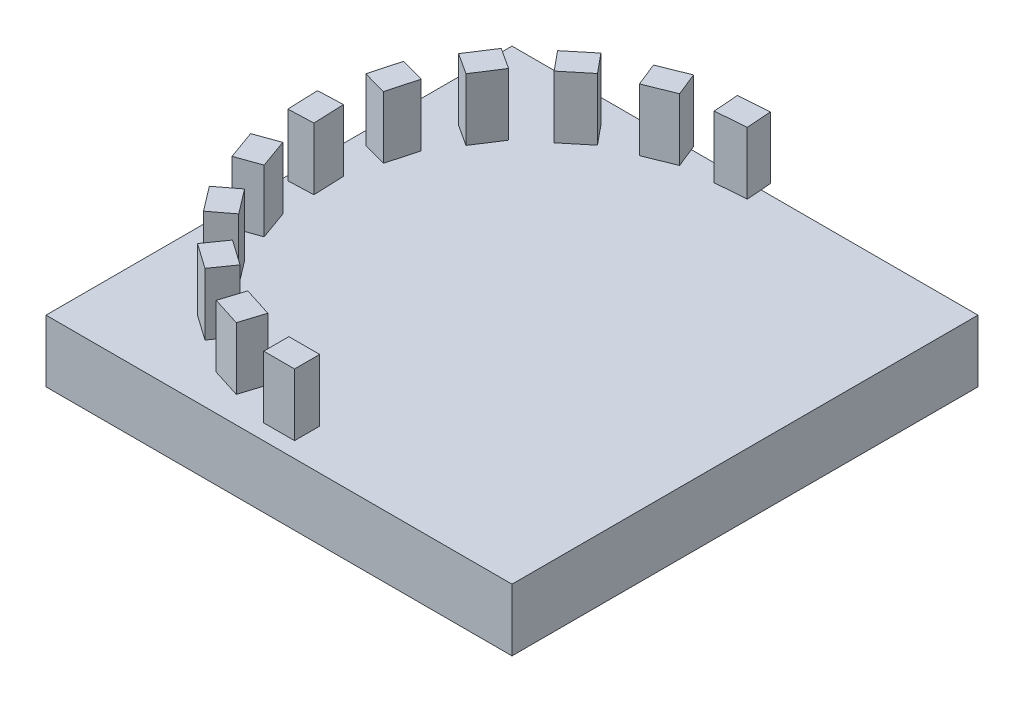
ISO-10303-21;
HEADER;
FILE_DESCRIPTION(('STEP AP214'),'2;1');
FILE_NAME('part.step','',(''),(''),'','','');
FILE_SCHEMA(('AUTOMOTIVE_DESIGN { 1 0 10303 214 1 1 1 1 }'));
ENDSEC;
DATA;
#1=APPLICATION_CONTEXT('core data for automotive mechanical design processes');
#2=APPLICATION_PROTOCOL_DEFINITION('international standard','automotive_design',2000,#1);
#3=PRODUCT_CONTEXT('',#1,'mechanical');
#4=PRODUCT('Part','Part','',(#3));
#5=PRODUCT_RELATED_PRODUCT_CATEGORY('part','',(#4));
#6=PRODUCT_DEFINITION_FORMATION('','',#4);
#7=PRODUCT_DEFINITION_CONTEXT('part definition',#1,'design');
#8=PRODUCT_DEFINITION('design','',#6,#7);
#9=PRODUCT_DEFINITION_SHAPE('','',#8);
#10=(LENGTH_UNIT() NAMED_UNIT(*) SI_UNIT(.MILLI.,.METRE.));
#11=(NAMED_UNIT(*) PLANE_ANGLE_UNIT() SI_UNIT($,.RADIAN.));
#12=(NAMED_UNIT(*) SI_UNIT($,.STERADIAN.) SOLID_ANGLE_UNIT());
#13=UNCERTAINTY_MEASURE_WITH_UNIT(LENGTH_MEASURE(1.E-05),#10,'distance_accuracy_value','');
#14=(GEOMETRIC_REPRESENTATION_CONTEXT(3) GLOBAL_UNCERTAINTY_ASSIGNED_CONTEXT((#13)) GLOBAL_UNIT_ASSIGNED_CONTEXT((#10,
#11,#12)) REPRESENTATION_CONTEXT('',''));
#15=CARTESIAN_POINT('',(0.,0.,0.));
#16=DIRECTION('',(0.,0.,1.));
#17=DIRECTION('',(1.,0.,0.));
#18=AXIS2_PLACEMENT_3D('',#15,#16,#17);
#19=CARTESIAN_POINT('',(-75.,20.,75.));
#20=DIRECTION('',(0.,1.,0.));
#21=DIRECTION('',(0.,0.,1.));
#22=AXIS2_PLACEMENT_3D('',#19,#20,#21);
#23=PLANE('',#22);
#24=DIRECTION('',(0.544504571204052,0.,-0.838757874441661));
#25=VECTOR('',#24,1.);
#26=CARTESIAN_POINT('',(-54.7088211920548,20.,-39.8959868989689));
#27=LINE('',#26,#25);
#28=CARTESIAN_POINT('',(-54.7088211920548,20.,-39.8959868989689));
#29=VERTEX_POINT('',#28);
#30=CARTESIAN_POINT('',(-49.3096520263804,20.,-48.2128971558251));
#31=VERTEX_POINT('',#30);
#32=EDGE_CURVE('E455',#29,#31,#27,.T.);
#33=ORIENTED_EDGE('',*,*,#32,.F.);
#34=DIRECTION('',(0.838757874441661,0.,0.544504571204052));
#35=VECTOR('',#34,1.);
#36=CARTESIAN_POINT('',(-61.4935161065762,20.,-44.300472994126));
#37=LINE('',#36,#35);
#38=CARTESIAN_POINT('',(-61.4935161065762,20.,-44.300472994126));
#39=VERTEX_POINT('',#38);
#40=EDGE_CURVE('E452',#39,#29,#37,.T.);
#41=ORIENTED_EDGE('',*,*,#40,.F.);
#42=DIRECTION('',(-0.544504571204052,0.,0.838757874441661));
#43=VECTOR('',#42,1.);
#44=CARTESIAN_POINT('',(-61.4935161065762,20.,-44.300472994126));
#45=LINE('',#44,#43);
#46=CARTESIAN_POINT('',(-56.0943469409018,20.,-52.6173832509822));
#47=VERTEX_POINT('',#46);
#48=EDGE_CURVE('E460',#47,#39,#45,.T.);
#49=ORIENTED_EDGE('',*,*,#48,.F.);
#50=DIRECTION('',(-0.838757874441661,0.,-0.544504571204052));
#51=VECTOR('',#50,1.);
#52=CARTESIAN_POINT('',(-56.0943469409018,20.,-52.6173832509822));
#53=LINE('',#52,#51);
#54=EDGE_CURVE('E457',#31,#47,#53,.T.);
#55=ORIENTED_EDGE('',*,*,#54,.F.);
#56=EDGE_LOOP('',(#33,#41,#49,#55));
#57=FACE_BOUND('',#56,.T.);
#58=DIRECTION('',(-0.0375056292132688,0.,-0.999296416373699));
#59=VECTOR('',#58,1.);
#60=CARTESIAN_POINT('',(-65.4339364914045,20.,-1.67025575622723));
#61=LINE('',#60,#59);
#62=CARTESIAN_POINT('',(-65.4339364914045,20.,-1.67025575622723));
#63=VERTEX_POINT('',#62);
#64=CARTESIAN_POINT('',(-65.805832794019,20.,-11.5790254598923));
#65=VERTEX_POINT('',#64);
#66=EDGE_CURVE('E513',#63,#65,#61,.T.);
#67=ORIENTED_EDGE('',*,*,#66,.F.);
#68=DIRECTION('',(0.999296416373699,0.,-0.0375056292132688));
#69=VECTOR('',#68,1.);
#70=CARTESIAN_POINT('',(-73.5172243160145,20.,-1.36687350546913));
#71=LINE('',#70,#69);
#72=CARTESIAN_POINT('',(-73.5172243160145,20.,-1.36687350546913));
#73=VERTEX_POINT('',#72);
#74=EDGE_CURVE('E510',#73,#63,#71,.T.);
#75=ORIENTED_EDGE('',*,*,#74,.F.);
#76=DIRECTION('',(0.0375056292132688,0.,0.999296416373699));
#77=VECTOR('',#76,1.);
#78=CARTESIAN_POINT('',(-73.5172243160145,20.,-1.36687350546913));
#79=LINE('',#78,#77);
#80=CARTESIAN_POINT('',(-73.8891206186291,20.,-11.2756432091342));
#81=VERTEX_POINT('',#80);
#82=EDGE_CURVE('E518',#81,#73,#79,.T.);
#83=ORIENTED_EDGE('',*,*,#82,.F.);
#84=DIRECTION('',(-0.999296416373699,0.,0.0375056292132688));
#85=VECTOR('',#84,1.);
#86=CARTESIAN_POINT('',(-73.8891206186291,20.,-11.2756432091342));
#87=LINE('',#86,#85);
#88=EDGE_CURVE('E515',#65,#81,#87,.T.);
#89=ORIENTED_EDGE('',*,*,#88,.F.);
#90=EDGE_LOOP('',(#67,#75,#83,#89));
#91=FACE_BOUND('',#90,.T.);
#92=DIRECTION('',(-0.605844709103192,0.,-0.795582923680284));
#93=VECTOR('',#92,1.);
#94=CARTESIAN_POINT('',(-52.2024025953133,20.,35.7618311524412));
#95=LINE('',#94,#93);
#96=CARTESIAN_POINT('',(-52.2024025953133,20.,35.7618311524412));
#97=VERTEX_POINT('',#96);
#98=CARTESIAN_POINT('',(-58.2098050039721,20.,27.873032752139));
#99=VERTEX_POINT('',#98);
#100=EDGE_CURVE('E571',#97,#99,#95,.T.);
#101=ORIENTED_EDGE('',*,*,#100,.F.);
#102=DIRECTION('',(0.795582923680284,0.,-0.605844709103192));
#103=VECTOR('',#102,1.);
#104=CARTESIAN_POINT('',(-58.6378562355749,20.,40.662496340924));
#105=LINE('',#104,#103);
#106=CARTESIAN_POINT('',(-58.6378562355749,20.,40.662496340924));
#107=VERTEX_POINT('',#106);
#108=EDGE_CURVE('E568',#107,#97,#105,.T.);
#109=ORIENTED_EDGE('',*,*,#108,.F.);
#110=DIRECTION('',(0.605844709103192,0.,0.795582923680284));
#111=VECTOR('',#110,1.);
#112=CARTESIAN_POINT('',(-58.6378562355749,20.,40.662496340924));
#113=LINE('',#112,#111);
#114=CARTESIAN_POINT('',(-64.6452586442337,20.,32.7736979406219));
#115=VERTEX_POINT('',#114);
#116=EDGE_CURVE('E576',#115,#107,#113,.T.);
#117=ORIENTED_EDGE('',*,*,#116,.F.);
#118=DIRECTION('',(-0.795582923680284,0.,0.605844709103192));
#119=VECTOR('',#118,1.);
#120=CARTESIAN_POINT('',(-64.6452586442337,20.,32.7736979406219));
#121=LINE('',#120,#119);
#122=EDGE_CURVE('E573',#99,#115,#121,.T.);
#123=ORIENTED_EDGE('',*,*,#122,.F.);
#124=EDGE_LOOP('',(#101,#109,#117,#123));
#125=FACE_BOUND('',#124,.T.);
#126=DIRECTION('',(-0.953348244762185,0.,-0.301872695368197));
#127=VECTOR('',#126,1.);
#128=CARTESIAN_POINT('',(-19.837226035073,20.,58.7559600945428));
#129=LINE('',#128,#127);
#130=CARTESIAN_POINT('',(-19.837226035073,20.,58.7559600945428));
#131=VERTEX_POINT('',#130);
#132=CARTESIAN_POINT('',(-29.2903853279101,20.,55.7626670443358));
#133=VERTEX_POINT('',#132);
#134=EDGE_CURVE('E629',#131,#133,#129,.T.);
#135=ORIENTED_EDGE('',*,*,#134,.F.);
#136=DIRECTION('',(0.301872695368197,0.,-0.953348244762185));
#137=VECTOR('',#136,1.);
#138=CARTESIAN_POINT('',(-22.2790679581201,20.,66.4675741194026));
#139=LINE('',#138,#137);
#140=CARTESIAN_POINT('',(-22.2790679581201,20.,66.4675741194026));
#141=VERTEX_POINT('',#140);
#142=EDGE_CURVE('E626',#141,#131,#139,.T.);
#143=ORIENTED_EDGE('',*,*,#142,.F.);
#144=DIRECTION('',(0.953348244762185,0.,0.301872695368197));
#145=VECTOR('',#144,1.);
#146=CARTESIAN_POINT('',(-22.2790679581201,20.,66.4675741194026));
#147=LINE('',#146,#145);
#148=CARTESIAN_POINT('',(-31.7322272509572,20.,63.4742810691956));
#149=VERTEX_POINT('',#148);
#150=EDGE_CURVE('E634',#149,#141,#147,.T.);
#151=ORIENTED_EDGE('',*,*,#150,.F.);
#152=DIRECTION('',(-0.301872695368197,0.,0.953348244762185));
#153=VECTOR('',#152,1.);
#154=CARTESIAN_POINT('',(-31.7322272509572,20.,63.4742810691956));
#155=LINE('',#154,#153);
#156=EDGE_CURVE('E631',#133,#149,#155,.T.);
#157=ORIENTED_EDGE('',*,*,#156,.F.);
#158=EDGE_LOOP('',(#135,#143,#151,#157));
#159=FACE_BOUND('',#158,.T.);
#160=DIRECTION('',(-1.,0.,0.));
#161=VECTOR('',#160,1.);
#162=CARTESIAN_POINT('',(0.,20.,61.9110209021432));
#163=LINE('',#162,#161);
#164=CARTESIAN_POINT('',(0.,20.,61.9110209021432));
#165=VERTEX_POINT('',#164);
#166=CARTESIAN_POINT('',(-9.91574626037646,20.,61.9110209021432));
#167=VERTEX_POINT('',#166);
#168=EDGE_CURVE('E658',#165,#167,#163,.T.);
#169=ORIENTED_EDGE('',*,*,#168,.F.);
#170=DIRECTION('',(0.,0.,-1.));
#171=VECTOR('',#170,1.);
#172=CARTESIAN_POINT('',(0.,20.,70.));
#173=LINE('',#172,#171);
#174=CARTESIAN_POINT('',(0.,20.,70.));
#175=VERTEX_POINT('',#174);
#176=EDGE_CURVE('E655',#175,#165,#173,.T.);
#177=ORIENTED_EDGE('',*,*,#176,.F.);
#178=DIRECTION('',(1.,0.,0.));
#179=VECTOR('',#178,1.);
#180=CARTESIAN_POINT('',(0.,20.,70.));
#181=LINE('',#180,#179);
#182=CARTESIAN_POINT('',(-9.91574626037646,20.,70.));
#183=VERTEX_POINT('',#182);
#184=EDGE_CURVE('E663',#183,#175,#181,.T.);
#185=ORIENTED_EDGE('',*,*,#184,.F.);
#186=DIRECTION('',(0.,0.,1.));
#187=VECTOR('',#186,1.);
#188=CARTESIAN_POINT('',(-9.91574626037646,20.,70.));
#189=LINE('',#188,#187);
#190=EDGE_CURVE('E660',#167,#183,#189,.T.);
#191=ORIENTED_EDGE('',*,*,#190,.F.);
#192=EDGE_LOOP('',(#169,#177,#185,#191));
#193=FACE_BOUND('',#192,.T.);
#194=DIRECTION('',(-0.817745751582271,0.,-0.575579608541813));
#195=VECTOR('',#194,1.);
#196=CARTESIAN_POINT('',(-37.7965839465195,20.,49.7597715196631));
#197=LINE('',#196,#195);
#198=CARTESIAN_POINT('',(-37.7965839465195,20.,49.7597715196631));
#199=VERTEX_POINT('',#198);
#200=CARTESIAN_POINT('',(-45.9051433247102,20.,44.0524701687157));
#201=VERTEX_POINT('',#200);
#202=EDGE_CURVE('E600',#199,#201,#197,.T.);
#203=ORIENTED_EDGE('',*,*,#202,.F.);
#204=DIRECTION('',(0.575579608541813,0.,-0.817745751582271));
#205=VECTOR('',#204,1.);
#206=CARTESIAN_POINT('',(-42.4524353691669,20.,56.3744998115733));
#207=LINE('',#206,#205);
#208=CARTESIAN_POINT('',(-42.4524353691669,20.,56.3744998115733));
#209=VERTEX_POINT('',#208);
#210=EDGE_CURVE('E597',#209,#199,#207,.T.);
#211=ORIENTED_EDGE('',*,*,#210,.F.);
#212=DIRECTION('',(0.817745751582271,0.,0.575579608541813));
#213=VECTOR('',#212,1.);
#214=CARTESIAN_POINT('',(-42.4524353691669,20.,56.3744998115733));
#215=LINE('',#214,#213);
#216=CARTESIAN_POINT('',(-50.5609947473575,20.,50.6671984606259));
#217=VERTEX_POINT('',#216);
#218=EDGE_CURVE('E605',#217,#209,#215,.T.);
#219=ORIENTED_EDGE('',*,*,#218,.F.);
#220=DIRECTION('',(-0.575579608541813,0.,0.817745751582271));
#221=VECTOR('',#220,1.);
#222=CARTESIAN_POINT('',(-50.5609947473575,20.,50.6671984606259));
#223=LINE('',#222,#221);
#224=EDGE_CURVE('E602',#201,#217,#223,.T.);
#225=ORIENTED_EDGE('',*,*,#224,.F.);
#226=EDGE_LOOP('',(#203,#211,#219,#225));
#227=FACE_BOUND('',#226,.T.);
#228=DIRECTION('',(-0.337416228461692,0.,-0.941355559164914));
#229=VECTOR('',#228,1.);
#230=CARTESIAN_POINT('',(-61.7105685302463,20.,18.0681959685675));
#231=LINE('',#230,#229);
#232=CARTESIAN_POINT('',(-61.7105685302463,20.,18.0681959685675));
#233=VERTEX_POINT('',#232);
#234=CARTESIAN_POINT('',(-65.0563022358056,20.,8.73395310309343));
#235=VERTEX_POINT('',#234);
#236=EDGE_CURVE('E542',#233,#235,#231,.T.);
#237=ORIENTED_EDGE('',*,*,#236,.F.);
#238=DIRECTION('',(0.941355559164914,0.,-0.337416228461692));
#239=VECTOR('',#238,1.);
#240=CARTESIAN_POINT('',(-69.3251739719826,20.,20.7975487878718));
#241=LINE('',#240,#239);
#242=CARTESIAN_POINT('',(-69.3251739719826,20.,20.7975487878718));
#243=VERTEX_POINT('',#242);
#244=EDGE_CURVE('E539',#243,#233,#241,.T.);
#245=ORIENTED_EDGE('',*,*,#244,.F.);
#246=DIRECTION('',(0.337416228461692,0.,0.941355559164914));
#247=VECTOR('',#246,1.);
#248=CARTESIAN_POINT('',(-69.3251739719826,20.,20.7975487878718));
#249=LINE('',#248,#247);
#250=CARTESIAN_POINT('',(-72.6709076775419,20.,11.4633059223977));
#251=VERTEX_POINT('',#250);
#252=EDGE_CURVE('E547',#251,#243,#249,.T.);
#253=ORIENTED_EDGE('',*,*,#252,.F.);
#254=DIRECTION('',(-0.941355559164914,0.,0.337416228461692));
#255=VECTOR('',#254,1.);
#256=CARTESIAN_POINT('',(-72.6709076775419,20.,11.4633059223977));
#257=LINE('',#256,#255);
#258=EDGE_CURVE('E544',#235,#251,#257,.T.);
#259=ORIENTED_EDGE('',*,*,#258,.F.);
#260=EDGE_LOOP('',(#237,#245,#253,#259));
#261=FACE_BOUND('',#260,.T.);
#262=DIRECTION('',(0.265904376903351,0.,-0.963999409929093));
#263=VECTOR('',#262,1.);
#264=CARTESIAN_POINT('',(-63.0251031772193,20.,-21.6118571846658));
#265=LINE('',#264,#263);
#266=CARTESIAN_POINT('',(-63.0251031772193,20.,-21.6118571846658));
#267=VERTEX_POINT('',#266);
#268=CARTESIAN_POINT('',(-60.3884628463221,20.,-31.1706307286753));
#269=VERTEX_POINT('',#268);
#270=EDGE_CURVE('E484',#267,#269,#265,.T.);
#271=ORIENTED_EDGE('',*,*,#270,.F.);
#272=DIRECTION('',(0.963999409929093,0.,0.265904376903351));
#273=VECTOR('',#272,1.);
#274=CARTESIAN_POINT('',(-70.822874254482,20.,-23.7627521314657));
#275=LINE('',#274,#273);
#276=CARTESIAN_POINT('',(-70.822874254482,20.,-23.7627521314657));
#277=VERTEX_POINT('',#276);
#278=EDGE_CURVE('E481',#277,#267,#275,.T.);
#279=ORIENTED_EDGE('',*,*,#278,.F.);
#280=DIRECTION('',(-0.265904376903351,0.,0.963999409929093));
#281=VECTOR('',#280,1.);
#282=CARTESIAN_POINT('',(-70.822874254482,20.,-23.7627521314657));
#283=LINE('',#282,#281);
#284=CARTESIAN_POINT('',(-68.1862339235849,20.,-33.3215256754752));
#285=VERTEX_POINT('',#284);
#286=EDGE_CURVE('E489',#285,#277,#283,.T.);
#287=ORIENTED_EDGE('',*,*,#286,.F.);
#288=DIRECTION('',(-0.963999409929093,0.,-0.265904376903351));
#289=VECTOR('',#288,1.);
#290=CARTESIAN_POINT('',(-68.1862339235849,20.,-33.3215256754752));
#291=LINE('',#290,#289);
#292=EDGE_CURVE('E486',#269,#285,#291,.T.);
#293=ORIENTED_EDGE('',*,*,#292,.F.);
#294=EDGE_LOOP('',(#271,#279,#287,#293));
#295=FACE_BOUND('',#294,.T.);
#296=DIRECTION('',(0.772300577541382,0.,-0.635257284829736));
#297=VECTOR('',#296,1.);
#298=CARTESIAN_POINT('',(-41.2610288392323,20.,-54.8166714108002));
#299=LINE('',#298,#297);
#300=CARTESIAN_POINT('',(-41.2610288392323,20.,-54.8166714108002));
#301=VERTEX_POINT('',#300);
#302=CARTESIAN_POINT('',(-33.6030922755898,20.,-61.1157214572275));
#303=VERTEX_POINT('',#302);
#304=EDGE_CURVE('E426',#301,#303,#299,.T.);
#305=ORIENTED_EDGE('',*,*,#304,.F.);
#306=DIRECTION('',(0.635257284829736,0.,0.772300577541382));
#307=VECTOR('',#306,1.);
#308=CARTESIAN_POINT('',(-46.3996117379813,20.,-61.0637946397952));
#309=LINE('',#308,#307);
#310=CARTESIAN_POINT('',(-46.3996117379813,20.,-61.0637946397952));
#311=VERTEX_POINT('',#310);
#312=EDGE_CURVE('E423',#311,#301,#309,.T.);
#313=ORIENTED_EDGE('',*,*,#312,.F.);
#314=DIRECTION('',(-0.772300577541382,0.,0.635257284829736));
#315=VECTOR('',#314,1.);
#316=CARTESIAN_POINT('',(-46.3996117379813,20.,-61.0637946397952));
#317=LINE('',#316,#315);
#318=CARTESIAN_POINT('',(-38.7416751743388,20.,-67.3628446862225));
#319=VERTEX_POINT('',#318);
#320=EDGE_CURVE('E431',#319,#311,#317,.T.);
#321=ORIENTED_EDGE('',*,*,#320,.F.);
#322=DIRECTION('',(-0.635257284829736,0.,-0.772300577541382));
#323=VECTOR('',#322,1.);
#324=CARTESIAN_POINT('',(-38.7416751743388,20.,-67.3628446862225));
#325=LINE('',#324,#323);
#326=EDGE_CURVE('E428',#303,#319,#325,.T.);
#327=ORIENTED_EDGE('',*,*,#326,.F.);
#328=EDGE_LOOP('',(#305,#313,#321,#327));
#329=FACE_BOUND('',#328,.T.);
#330=DIRECTION('',(0.997186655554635,0.,-0.0749584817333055));
#331=VECTOR('',#330,1.);
#332=CARTESIAN_POINT('',(-4.3515355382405,20.,-69.4428097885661));
#333=LINE('',#332,#331);
#334=CARTESIAN_POINT('',(-4.35153553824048,20.,-69.4428097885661));
#335=VERTEX_POINT('',#334);
#336=CARTESIAN_POINT('',(5.53631431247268,20.,-70.1860790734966));
#337=VERTEX_POINT('',#336);
#338=EDGE_CURVE('E46',#335,#337,#333,.T.);
#339=ORIENTED_EDGE('',*,*,#338,.F.);
#340=DIRECTION('',(0.0749584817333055,0.,0.997186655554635));
#341=VECTOR('',#340,1.);
#342=CARTESIAN_POINT('',(-4.95787313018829,20.,-77.5090318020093));
#343=LINE('',#342,#341);
#344=CARTESIAN_POINT('',(-4.76926930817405,20.,-75.));
#345=VERTEX_POINT('',#344);
#346=EDGE_CURVE('E734',#345,#335,#343,.T.);
#347=ORIENTED_EDGE('',*,*,#346,.F.);
#348=DIRECTION('',(-1.,0.,0.));
#349=VECTOR('',#348,1.);
#350=CARTESIAN_POINT('',(-75.,20.,-75.));
#351=LINE('',#350,#349);
#352=CARTESIAN_POINT('',(-17.2728238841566,20.,-75.));
#353=VERTEX_POINT('',#352);
#354=EDGE_CURVE('E705',#345,#353,#351,.T.);
#355=ORIENTED_EDGE('',*,*,#354,.T.);
#356=DIRECTION('',(-0.372484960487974,0.,-0.928038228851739));
#357=VECTOR('',#356,1.);
#358=CARTESIAN_POINT('',(-17.7472838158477,20.,-76.182106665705));
#359=LINE('',#358,#357);
#360=CARTESIAN_POINT('',(-14.7342607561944,20.,-68.6752248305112));
#361=VERTEX_POINT('',#360);
#362=EDGE_CURVE('E395',#361,#353,#359,.T.);
#363=ORIENTED_EDGE('',*,*,#362,.F.);
#364=DIRECTION('',(0.928038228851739,0.,-0.372484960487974));
#365=VECTOR('',#364,1.);
#366=CARTESIAN_POINT('',(-23.9364523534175,20.,-64.9817584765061));
#367=LINE('',#366,#365);
#368=CARTESIAN_POINT('',(-23.9364523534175,20.,-64.9817584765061));
#369=VERTEX_POINT('',#368);
#370=EDGE_CURVE('E391',#369,#361,#367,.T.);
#371=ORIENTED_EDGE('',*,*,#370,.F.);
#372=DIRECTION('',(0.372484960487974,0.,0.928038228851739));
#373=VECTOR('',#372,1.);
#374=CARTESIAN_POINT('',(-26.9494754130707,20.,-72.4886403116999));
#375=LINE('',#374,#373);
#376=CARTESIAN_POINT('',(-26.9494754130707,20.,-72.4886403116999));
#377=VERTEX_POINT('',#376);
#378=EDGE_CURVE('E388',#377,#369,#375,.T.);
#379=ORIENTED_EDGE('',*,*,#378,.F.);
#380=DIRECTION('',(-0.928038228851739,0.,0.372484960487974));
#381=VECTOR('',#380,1.);
#382=CARTESIAN_POINT('',(-26.9494754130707,20.,-72.4886403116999));
#383=LINE('',#382,#381);
#384=CARTESIAN_POINT('',(-20.692477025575,20.,-75.));
#385=VERTEX_POINT('',#384);
#386=EDGE_CURVE('E398',#385,#377,#383,.T.);
#387=ORIENTED_EDGE('',*,*,#386,.F.);
#388=CARTESIAN_POINT('',(-75.,20.,-75.));
#389=VERTEX_POINT('',#388);
#390=EDGE_CURVE('E700',#385,#389,#351,.T.);
#391=ORIENTED_EDGE('',*,*,#390,.T.);
#392=DIRECTION('',(0.,0.,1.));
#393=VECTOR('',#392,1.);
#394=CARTESIAN_POINT('',(-75.,20.,-75.));
#395=LINE('',#394,#393);
#396=CARTESIAN_POINT('',(-75.,20.,75.));
#397=VERTEX_POINT('',#396);
#398=EDGE_CURVE('E693',#389,#397,#395,.T.);
#399=ORIENTED_EDGE('',*,*,#398,.T.);
#400=DIRECTION('',(1.,0.,0.));
#401=VECTOR('',#400,1.);
#402=CARTESIAN_POINT('',(-75.,20.,75.));
#403=LINE('',#402,#401);
#404=CARTESIAN_POINT('',(75.,20.,75.));
#405=VERTEX_POINT('',#404);
#406=EDGE_CURVE('E696',#397,#405,#403,.T.);
#407=ORIENTED_EDGE('',*,*,#406,.T.);
#408=DIRECTION('',(0.,0.,-1.));
#409=VECTOR('',#408,1.);
#410=CARTESIAN_POINT('',(75.,20.,-75.));
#411=LINE('',#410,#409);
#412=CARTESIAN_POINT('',(75.,20.,-75.));
#413=VERTEX_POINT('',#412);
#414=EDGE_CURVE('E698',#405,#413,#411,.T.);
#415=ORIENTED_EDGE('',*,*,#414,.T.);
#416=CARTESIAN_POINT('',(5.17445206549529,20.,-75.));
#417=VERTEX_POINT('',#416);
#418=EDGE_CURVE('E701',#413,#417,#351,.T.);
#419=ORIENTED_EDGE('',*,*,#418,.T.);
#420=DIRECTION('',(-0.0749584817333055,0.,-0.997186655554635));
#421=VECTOR('',#420,1.);
#422=CARTESIAN_POINT('',(4.92997672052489,20.,-78.2523010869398));
#423=LINE('',#422,#421);
#424=EDGE_CURVE('E51',#337,#417,#423,.T.);
#425=ORIENTED_EDGE('',*,*,#424,.F.);
#426=EDGE_LOOP('',(#339,#347,#355,#363,#371,#379,#387,#391,#399,#407,#415,#419,#425));
#427=FACE_BOUND('',#426,.T.);
#428=ADVANCED_FACE('F31',(#57,#91,#125,#159,#193,#227,#261,#295,#329,#427),#23,.T.);
#429=CARTESIAN_POINT('',(-75.,20.,-75.));
#430=DIRECTION('',(1.,0.,0.));
#431=DIRECTION('',(0.,0.,-1.));
#432=AXIS2_PLACEMENT_3D('',#429,#430,#431);
#433=PLANE('',#432);
#434=DIRECTION('',(0.,0.,1.));
#435=VECTOR('',#434,1.);
#436=CARTESIAN_POINT('',(-75.,0.,-75.));
#437=LINE('',#436,#435);
#438=CARTESIAN_POINT('',(-75.,0.,-75.));
#439=VERTEX_POINT('',#438);
#440=CARTESIAN_POINT('',(-75.,0.,75.));
#441=VERTEX_POINT('',#440);
#442=EDGE_CURVE('E684',#439,#441,#437,.T.);
#443=ORIENTED_EDGE('',*,*,#442,.T.);
#444=DIRECTION('',(0.,-1.,0.));
#445=VECTOR('',#444,1.);
#446=CARTESIAN_POINT('',(-75.,20.,75.));
#447=LINE('',#446,#445);
#448=EDGE_CURVE('E11',#397,#441,#447,.T.);
#449=ORIENTED_EDGE('',*,*,#448,.F.);
#450=ORIENTED_EDGE('',*,*,#398,.F.);
#451=DIRECTION('',(0.,-1.,0.));
#452=VECTOR('',#451,1.);
#453=CARTESIAN_POINT('',(-75.,20.,-75.));
#454=LINE('',#453,#452);
#455=EDGE_CURVE('E703',#389,#439,#454,.T.);
#456=ORIENTED_EDGE('',*,*,#455,.T.);
#457=EDGE_LOOP('',(#443,#449,#450,#456));
#458=FACE_BOUND('',#457,.T.);
#459=ADVANCED_FACE('F33',(#458),#433,.F.);
#460=CARTESIAN_POINT('',(-75.,20.,75.));
#461=DIRECTION('',(0.,0.,-1.));
#462=DIRECTION('',(-1.,0.,0.));
#463=AXIS2_PLACEMENT_3D('',#460,#461,#462);
#464=PLANE('',#463);
#465=DIRECTION('',(1.,0.,0.));
#466=VECTOR('',#465,1.);
#467=CARTESIAN_POINT('',(-75.,0.,75.));
#468=LINE('',#467,#466);
#469=CARTESIAN_POINT('',(75.,0.,75.));
#470=VERTEX_POINT('',#469);
#471=EDGE_CURVE('E687',#441,#470,#468,.T.);
#472=ORIENTED_EDGE('',*,*,#471,.T.);
#473=DIRECTION('',(0.,-1.,0.));
#474=VECTOR('',#473,1.);
#475=CARTESIAN_POINT('',(75.,20.,75.));
#476=LINE('',#475,#474);
#477=EDGE_CURVE('E39',#405,#470,#476,.T.);
#478=ORIENTED_EDGE('',*,*,#477,.F.);
#479=ORIENTED_EDGE('',*,*,#406,.F.);
#480=ORIENTED_EDGE('',*,*,#448,.T.);
#481=EDGE_LOOP('',(#472,#478,#479,#480));
#482=FACE_BOUND('',#481,.T.);
#483=ADVANCED_FACE('F772',(#482),#464,.F.);
#484=CARTESIAN_POINT('',(75.,20.,-75.));
#485=DIRECTION('',(-1.,0.,0.));
#486=DIRECTION('',(0.,0.,1.));
#487=AXIS2_PLACEMENT_3D('',#484,#485,#486);
#488=PLANE('',#487);
#489=DIRECTION('',(0.,0.,-1.));
#490=VECTOR('',#489,1.);
#491=CARTESIAN_POINT('',(75.,0.,-75.));
#492=LINE('',#491,#490);
#493=CARTESIAN_POINT('',(75.,0.,-75.));
#494=VERTEX_POINT('',#493);
#495=EDGE_CURVE('E689',#470,#494,#492,.T.);
#496=ORIENTED_EDGE('',*,*,#495,.T.);
#497=DIRECTION('',(0.,-1.,0.));
#498=VECTOR('',#497,1.);
#499=CARTESIAN_POINT('',(75.,20.,-75.));
#500=LINE('',#499,#498);
#501=EDGE_CURVE('E709',#413,#494,#500,.T.);
#502=ORIENTED_EDGE('',*,*,#501,.F.);
#503=ORIENTED_EDGE('',*,*,#414,.F.);
#504=ORIENTED_EDGE('',*,*,#477,.T.);
#505=EDGE_LOOP('',(#496,#502,#503,#504));
#506=FACE_BOUND('',#505,.T.);
#507=ADVANCED_FACE('F716',(#506),#488,.F.);
#508=CARTESIAN_POINT('',(-75.,20.,-75.));
#509=DIRECTION('',(0.,0.,1.));
#510=DIRECTION('',(1.,0.,0.));
#511=AXIS2_PLACEMENT_3D('',#508,#509,#510);
#512=PLANE('',#511);
#513=DIRECTION('',(-1.,0.,0.));
#514=VECTOR('',#513,1.);
#515=CARTESIAN_POINT('',(-75.,0.,-75.));
#516=LINE('',#515,#514);
#517=EDGE_CURVE('E691',#494,#439,#516,.T.);
#518=ORIENTED_EDGE('',*,*,#517,.T.);
#519=ORIENTED_EDGE('',*,*,#455,.F.);
#520=ORIENTED_EDGE('',*,*,#390,.F.);
#521=EDGE_CURVE('E706',#353,#385,#351,.T.);
#522=ORIENTED_EDGE('',*,*,#521,.F.);
#523=ORIENTED_EDGE('',*,*,#354,.F.);
#524=EDGE_CURVE('E704',#417,#345,#351,.T.);
#525=ORIENTED_EDGE('',*,*,#524,.F.);
#526=ORIENTED_EDGE('',*,*,#418,.F.);
#527=ORIENTED_EDGE('',*,*,#501,.T.);
#528=EDGE_LOOP('',(#518,#519,#520,#522,#523,#525,#526,#527));
#529=FACE_BOUND('',#528,.T.);
#530=ADVANCED_FACE('F725',(#529),#512,.F.);
#531=CARTESIAN_POINT('',(-75.,0.,75.));
#532=DIRECTION('',(0.,1.,0.));
#533=DIRECTION('',(0.,0.,1.));
#534=AXIS2_PLACEMENT_3D('',#531,#532,#533);
#535=PLANE('',#534);
#536=ORIENTED_EDGE('',*,*,#442,.F.);
#537=ORIENTED_EDGE('',*,*,#517,.F.);
#538=ORIENTED_EDGE('',*,*,#495,.F.);
#539=ORIENTED_EDGE('',*,*,#471,.F.);
#540=EDGE_LOOP('',(#536,#537,#538,#539));
#541=FACE_BOUND('',#540,.T.);
#542=ADVANCED_FACE('F722',(#541),#535,.F.);
#543=CARTESIAN_POINT('',(0.,40.,70.));
#544=DIRECTION('',(-1.,0.,0.));
#545=DIRECTION('',(0.,0.,1.));
#546=AXIS2_PLACEMENT_3D('',#543,#544,#545);
#547=PLANE('',#546);
#548=ORIENTED_EDGE('',*,*,#176,.T.);
#549=DIRECTION('',(0.,-1.,0.));
#550=VECTOR('',#549,1.);
#551=CARTESIAN_POINT('',(0.,40.,61.9110209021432));
#552=LINE('',#551,#550);
#553=CARTESIAN_POINT('',(0.,40.,61.9110209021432));
#554=VERTEX_POINT('',#553);
#555=EDGE_CURVE('E682',#554,#165,#552,.T.);
#556=ORIENTED_EDGE('',*,*,#555,.F.);
#557=DIRECTION('',(0.,0.,-1.));
#558=VECTOR('',#557,1.);
#559=CARTESIAN_POINT('',(0.,40.,70.));
#560=LINE('',#559,#558);
#561=CARTESIAN_POINT('',(0.,40.,70.));
#562=VERTEX_POINT('',#561);
#563=EDGE_CURVE('E665',#562,#554,#560,.T.);
#564=ORIENTED_EDGE('',*,*,#563,.F.);
#565=DIRECTION('',(0.,-1.,0.));
#566=VECTOR('',#565,1.);
#567=CARTESIAN_POINT('',(0.,40.,70.));
#568=LINE('',#567,#566);
#569=EDGE_CURVE('E674',#562,#175,#568,.T.);
#570=ORIENTED_EDGE('',*,*,#569,.T.);
#571=EDGE_LOOP('',(#548,#556,#564,#570));
#572=FACE_BOUND('',#571,.T.);
#573=ADVANCED_FACE('F801',(#572),#547,.F.);
#574=CARTESIAN_POINT('',(0.,40.,61.9110209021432));
#575=DIRECTION('',(0.,0.,1.));
#576=DIRECTION('',(1.,0.,0.));
#577=AXIS2_PLACEMENT_3D('',#574,#575,#576);
#578=PLANE('',#577);
#579=ORIENTED_EDGE('',*,*,#168,.T.);
#580=DIRECTION('',(0.,-1.,0.));
#581=VECTOR('',#580,1.);
#582=CARTESIAN_POINT('',(-9.91574626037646,40.,61.9110209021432));
#583=LINE('',#582,#581);
#584=CARTESIAN_POINT('',(-9.91574626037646,40.,61.9110209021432));
#585=VERTEX_POINT('',#584);
#586=EDGE_CURVE('E679',#585,#167,#583,.T.);
#587=ORIENTED_EDGE('',*,*,#586,.F.);
#588=DIRECTION('',(-1.,0.,0.));
#589=VECTOR('',#588,1.);
#590=CARTESIAN_POINT('',(0.,40.,61.9110209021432));
#591=LINE('',#590,#589);
#592=EDGE_CURVE('E668',#554,#585,#591,.T.);
#593=ORIENTED_EDGE('',*,*,#592,.F.);
#594=ORIENTED_EDGE('',*,*,#555,.T.);
#595=EDGE_LOOP('',(#579,#587,#593,#594));
#596=FACE_BOUND('',#595,.T.);
#597=ADVANCED_FACE('F807',(#596),#578,.F.);
#598=CARTESIAN_POINT('',(-9.91574626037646,40.,70.));
#599=DIRECTION('',(1.,0.,0.));
#600=DIRECTION('',(0.,0.,-1.));
#601=AXIS2_PLACEMENT_3D('',#598,#599,#600);
#602=PLANE('',#601);
#603=ORIENTED_EDGE('',*,*,#190,.T.);
#604=DIRECTION('',(0.,-1.,0.));
#605=VECTOR('',#604,1.);
#606=CARTESIAN_POINT('',(-9.91574626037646,40.,70.));
#607=LINE('',#606,#605);
#608=CARTESIAN_POINT('',(-9.91574626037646,40.,70.));
#609=VERTEX_POINT('',#608);
#610=EDGE_CURVE('E677',#609,#183,#607,.T.);
#611=ORIENTED_EDGE('',*,*,#610,.F.);
#612=DIRECTION('',(0.,0.,1.));
#613=VECTOR('',#612,1.);
#614=CARTESIAN_POINT('',(-9.91574626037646,40.,70.));
#615=LINE('',#614,#613);
#616=EDGE_CURVE('E670',#585,#609,#615,.T.);
#617=ORIENTED_EDGE('',*,*,#616,.F.);
#618=ORIENTED_EDGE('',*,*,#586,.T.);
#619=EDGE_LOOP('',(#603,#611,#617,#618));
#620=FACE_BOUND('',#619,.T.);
#621=ADVANCED_FACE('F814',(#620),#602,.F.);
#622=CARTESIAN_POINT('',(0.,40.,70.));
#623=DIRECTION('',(0.,0.,-1.));
#624=DIRECTION('',(-1.,0.,0.));
#625=AXIS2_PLACEMENT_3D('',#622,#623,#624);
#626=PLANE('',#625);
#627=ORIENTED_EDGE('',*,*,#184,.T.);
#628=ORIENTED_EDGE('',*,*,#569,.F.);
#629=DIRECTION('',(1.,0.,0.));
#630=VECTOR('',#629,1.);
#631=CARTESIAN_POINT('',(0.,40.,70.));
#632=LINE('',#631,#630);
#633=EDGE_CURVE('E672',#609,#562,#632,.T.);
#634=ORIENTED_EDGE('',*,*,#633,.F.);
#635=ORIENTED_EDGE('',*,*,#610,.T.);
#636=EDGE_LOOP('',(#627,#628,#634,#635));
#637=FACE_BOUND('',#636,.T.);
#638=ADVANCED_FACE('F822',(#637),#626,.F.);
#639=CARTESIAN_POINT('',(0.,40.,61.9110209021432));
#640=DIRECTION('',(0.,1.,0.));
#641=DIRECTION('',(0.,0.,1.));
#642=AXIS2_PLACEMENT_3D('',#639,#640,#641);
#643=PLANE('',#642);
#644=ORIENTED_EDGE('',*,*,#563,.T.);
#645=ORIENTED_EDGE('',*,*,#592,.T.);
#646=ORIENTED_EDGE('',*,*,#616,.T.);
#647=ORIENTED_EDGE('',*,*,#633,.T.);
#648=EDGE_LOOP('',(#644,#645,#646,#647));
#649=FACE_BOUND('',#648,.T.);
#650=ADVANCED_FACE('F830',(#649),#643,.T.);
#651=CARTESIAN_POINT('',(-22.2790679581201,40.,66.4675741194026));
#652=DIRECTION('',(-0.953348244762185,0.,-0.301872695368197));
#653=DIRECTION('',(-0.301872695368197,0.,0.953348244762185));
#654=AXIS2_PLACEMENT_3D('',#651,#652,#653);
#655=PLANE('',#654);
#656=ORIENTED_EDGE('',*,*,#142,.T.);
#657=DIRECTION('',(0.,-1.,0.));
#658=VECTOR('',#657,1.);
#659=CARTESIAN_POINT('',(-19.837226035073,40.,58.7559600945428));
#660=LINE('',#659,#658);
#661=CARTESIAN_POINT('',(-19.837226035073,40.,58.7559600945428));
#662=VERTEX_POINT('',#661);
#663=EDGE_CURVE('E653',#662,#131,#660,.T.);
#664=ORIENTED_EDGE('',*,*,#663,.F.);
#665=DIRECTION('',(0.301872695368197,0.,-0.953348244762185));
#666=VECTOR('',#665,1.);
#667=CARTESIAN_POINT('',(-22.2790679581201,40.,66.4675741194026));
#668=LINE('',#667,#666);
#669=CARTESIAN_POINT('',(-22.2790679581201,40.,66.4675741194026));
#670=VERTEX_POINT('',#669);
#671=EDGE_CURVE('E636',#670,#662,#668,.T.);
#672=ORIENTED_EDGE('',*,*,#671,.F.);
#673=DIRECTION('',(0.,-1.,0.));
#674=VECTOR('',#673,1.);
#675=CARTESIAN_POINT('',(-22.2790679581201,40.,66.4675741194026));
#676=LINE('',#675,#674);
#677=EDGE_CURVE('E645',#670,#141,#676,.T.);
#678=ORIENTED_EDGE('',*,*,#677,.T.);
#679=EDGE_LOOP('',(#656,#664,#672,#678));
#680=FACE_BOUND('',#679,.T.);
#681=ADVANCED_FACE('F838',(#680),#655,.F.);
#682=CARTESIAN_POINT('',(-19.837226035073,40.,58.7559600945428));
#683=DIRECTION('',(-0.301872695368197,0.,0.953348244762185));
#684=DIRECTION('',(0.953348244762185,0.,0.301872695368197));
#685=AXIS2_PLACEMENT_3D('',#682,#683,#684);
#686=PLANE('',#685);
#687=ORIENTED_EDGE('',*,*,#134,.T.);
#688=DIRECTION('',(0.,-1.,0.));
#689=VECTOR('',#688,1.);
#690=CARTESIAN_POINT('',(-29.2903853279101,40.,55.7626670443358));
#691=LINE('',#690,#689);
#692=CARTESIAN_POINT('',(-29.2903853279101,40.,55.7626670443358));
#693=VERTEX_POINT('',#692);
#694=EDGE_CURVE('E650',#693,#133,#691,.T.);
#695=ORIENTED_EDGE('',*,*,#694,.F.);
#696=DIRECTION('',(-0.953348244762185,0.,-0.301872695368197));
#697=VECTOR('',#696,1.);
#698=CARTESIAN_POINT('',(-19.837226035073,40.,58.7559600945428));
#699=LINE('',#698,#697);
#700=EDGE_CURVE('E639',#662,#693,#699,.T.);
#701=ORIENTED_EDGE('',*,*,#700,.F.);
#702=ORIENTED_EDGE('',*,*,#663,.T.);
#703=EDGE_LOOP('',(#687,#695,#701,#702));
#704=FACE_BOUND('',#703,.T.);
#705=ADVANCED_FACE('F845',(#704),#686,.F.);
#706=CARTESIAN_POINT('',(-31.7322272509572,40.,63.4742810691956));
#707=DIRECTION('',(0.953348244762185,0.,0.301872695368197));
#708=DIRECTION('',(0.301872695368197,0.,-0.953348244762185));
#709=AXIS2_PLACEMENT_3D('',#706,#707,#708);
#710=PLANE('',#709);
#711=ORIENTED_EDGE('',*,*,#156,.T.);
#712=DIRECTION('',(0.,-1.,0.));
#713=VECTOR('',#712,1.);
#714=CARTESIAN_POINT('',(-31.7322272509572,40.,63.4742810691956));
#715=LINE('',#714,#713);
#716=CARTESIAN_POINT('',(-31.7322272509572,40.,63.4742810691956));
#717=VERTEX_POINT('',#716);
#718=EDGE_CURVE('E648',#717,#149,#715,.T.);
#719=ORIENTED_EDGE('',*,*,#718,.F.);
#720=DIRECTION('',(-0.301872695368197,0.,0.953348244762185));
#721=VECTOR('',#720,1.);
#722=CARTESIAN_POINT('',(-31.7322272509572,40.,63.4742810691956));
#723=LINE('',#722,#721);
#724=EDGE_CURVE('E641',#693,#717,#723,.T.);
#725=ORIENTED_EDGE('',*,*,#724,.F.);
#726=ORIENTED_EDGE('',*,*,#694,.T.);
#727=EDGE_LOOP('',(#711,#719,#725,#726));
#728=FACE_BOUND('',#727,.T.);
#729=ADVANCED_FACE('F853',(#728),#710,.F.);
#730=CARTESIAN_POINT('',(-22.2790679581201,40.,66.4675741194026));
#731=DIRECTION('',(0.301872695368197,0.,-0.953348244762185));
#732=DIRECTION('',(-0.953348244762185,0.,-0.301872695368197));
#733=AXIS2_PLACEMENT_3D('',#730,#731,#732);
#734=PLANE('',#733);
#735=ORIENTED_EDGE('',*,*,#150,.T.);
#736=ORIENTED_EDGE('',*,*,#677,.F.);
#737=DIRECTION('',(0.953348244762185,0.,0.301872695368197));
#738=VECTOR('',#737,1.);
#739=CARTESIAN_POINT('',(-22.2790679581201,40.,66.4675741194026));
#740=LINE('',#739,#738);
#741=EDGE_CURVE('E643',#717,#670,#740,.T.);
#742=ORIENTED_EDGE('',*,*,#741,.F.);
#743=ORIENTED_EDGE('',*,*,#718,.T.);
#744=EDGE_LOOP('',(#735,#736,#742,#743));
#745=FACE_BOUND('',#744,.T.);
#746=ADVANCED_FACE('F861',(#745),#734,.F.);
#747=CARTESIAN_POINT('',(-19.837226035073,40.,58.7559600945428));
#748=DIRECTION('',(0.,1.,0.));
#749=DIRECTION('',(-0.301872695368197,0.,0.953348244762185));
#750=AXIS2_PLACEMENT_3D('',#747,#748,#749);
#751=PLANE('',#750);
#752=ORIENTED_EDGE('',*,*,#671,.T.);
#753=ORIENTED_EDGE('',*,*,#700,.T.);
#754=ORIENTED_EDGE('',*,*,#724,.T.);
#755=ORIENTED_EDGE('',*,*,#741,.T.);
#756=EDGE_LOOP('',(#752,#753,#754,#755));
#757=FACE_BOUND('',#756,.T.);
#758=ADVANCED_FACE('F869',(#757),#751,.T.);
#759=CARTESIAN_POINT('',(-42.4524353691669,40.,56.3744998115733));
#760=DIRECTION('',(-0.817745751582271,0.,-0.575579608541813));
#761=DIRECTION('',(-0.575579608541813,0.,0.817745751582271));
#762=AXIS2_PLACEMENT_3D('',#759,#760,#761);
#763=PLANE('',#762);
#764=ORIENTED_EDGE('',*,*,#210,.T.);
#765=DIRECTION('',(0.,-1.,0.));
#766=VECTOR('',#765,1.);
#767=CARTESIAN_POINT('',(-37.7965839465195,40.,49.7597715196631));
#768=LINE('',#767,#766);
#769=CARTESIAN_POINT('',(-37.7965839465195,40.,49.7597715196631));
#770=VERTEX_POINT('',#769);
#771=EDGE_CURVE('E624',#770,#199,#768,.T.);
#772=ORIENTED_EDGE('',*,*,#771,.F.);
#773=DIRECTION('',(0.575579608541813,0.,-0.817745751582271));
#774=VECTOR('',#773,1.);
#775=CARTESIAN_POINT('',(-42.4524353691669,40.,56.3744998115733));
#776=LINE('',#775,#774);
#777=CARTESIAN_POINT('',(-42.4524353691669,40.,56.3744998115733));
#778=VERTEX_POINT('',#777);
#779=EDGE_CURVE('E607',#778,#770,#776,.T.);
#780=ORIENTED_EDGE('',*,*,#779,.F.);
#781=DIRECTION('',(0.,-1.,0.));
#782=VECTOR('',#781,1.);
#783=CARTESIAN_POINT('',(-42.4524353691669,40.,56.3744998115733));
#784=LINE('',#783,#782);
#785=EDGE_CURVE('E616',#778,#209,#784,.T.);
#786=ORIENTED_EDGE('',*,*,#785,.T.);
#787=EDGE_LOOP('',(#764,#772,#780,#786));
#788=FACE_BOUND('',#787,.T.);
#789=ADVANCED_FACE('F877',(#788),#763,.F.);
#790=CARTESIAN_POINT('',(-37.7965839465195,40.,49.7597715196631));
#791=DIRECTION('',(-0.575579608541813,0.,0.817745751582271));
#792=DIRECTION('',(0.817745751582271,0.,0.575579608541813));
#793=AXIS2_PLACEMENT_3D('',#790,#791,#792);
#794=PLANE('',#793);
#795=ORIENTED_EDGE('',*,*,#202,.T.);
#796=DIRECTION('',(0.,-1.,0.));
#797=VECTOR('',#796,1.);
#798=CARTESIAN_POINT('',(-45.9051433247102,40.,44.0524701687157));
#799=LINE('',#798,#797);
#800=CARTESIAN_POINT('',(-45.9051433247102,40.,44.0524701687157));
#801=VERTEX_POINT('',#800);
#802=EDGE_CURVE('E621',#801,#201,#799,.T.);
#803=ORIENTED_EDGE('',*,*,#802,.F.);
#804=DIRECTION('',(-0.817745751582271,0.,-0.575579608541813));
#805=VECTOR('',#804,1.);
#806=CARTESIAN_POINT('',(-37.7965839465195,40.,49.7597715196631));
#807=LINE('',#806,#805);
#808=EDGE_CURVE('E610',#770,#801,#807,.T.);
#809=ORIENTED_EDGE('',*,*,#808,.F.);
#810=ORIENTED_EDGE('',*,*,#771,.T.);
#811=EDGE_LOOP('',(#795,#803,#809,#810));
#812=FACE_BOUND('',#811,.T.);
#813=ADVANCED_FACE('F885',(#812),#794,.F.);
#814=CARTESIAN_POINT('',(-50.5609947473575,40.,50.6671984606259));
#815=DIRECTION('',(0.817745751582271,0.,0.575579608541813));
#816=DIRECTION('',(0.575579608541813,0.,-0.817745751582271));
#817=AXIS2_PLACEMENT_3D('',#814,#815,#816);
#818=PLANE('',#817);
#819=ORIENTED_EDGE('',*,*,#224,.T.);
#820=DIRECTION('',(0.,-1.,0.));
#821=VECTOR('',#820,1.);
#822=CARTESIAN_POINT('',(-50.5609947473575,40.,50.6671984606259));
#823=LINE('',#822,#821);
#824=CARTESIAN_POINT('',(-50.5609947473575,40.,50.6671984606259));
#825=VERTEX_POINT('',#824);
#826=EDGE_CURVE('E619',#825,#217,#823,.T.);
#827=ORIENTED_EDGE('',*,*,#826,.F.);
#828=DIRECTION('',(-0.575579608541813,0.,0.817745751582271));
#829=VECTOR('',#828,1.);
#830=CARTESIAN_POINT('',(-50.5609947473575,40.,50.6671984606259));
#831=LINE('',#830,#829);
#832=EDGE_CURVE('E612',#801,#825,#831,.T.);
#833=ORIENTED_EDGE('',*,*,#832,.F.);
#834=ORIENTED_EDGE('',*,*,#802,.T.);
#835=EDGE_LOOP('',(#819,#827,#833,#834));
#836=FACE_BOUND('',#835,.T.);
#837=ADVANCED_FACE('F893',(#836),#818,.F.);
#838=CARTESIAN_POINT('',(-42.4524353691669,40.,56.3744998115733));
#839=DIRECTION('',(0.575579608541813,0.,-0.817745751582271));
#840=DIRECTION('',(-0.817745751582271,0.,-0.575579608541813));
#841=AXIS2_PLACEMENT_3D('',#838,#839,#840);
#842=PLANE('',#841);
#843=ORIENTED_EDGE('',*,*,#218,.T.);
#844=ORIENTED_EDGE('',*,*,#785,.F.);
#845=DIRECTION('',(0.817745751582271,0.,0.575579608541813));
#846=VECTOR('',#845,1.);
#847=CARTESIAN_POINT('',(-42.4524353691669,40.,56.3744998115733));
#848=LINE('',#847,#846);
#849=EDGE_CURVE('E614',#825,#778,#848,.T.);
#850=ORIENTED_EDGE('',*,*,#849,.F.);
#851=ORIENTED_EDGE('',*,*,#826,.T.);
#852=EDGE_LOOP('',(#843,#844,#850,#851));
#853=FACE_BOUND('',#852,.T.);
#854=ADVANCED_FACE('F901',(#853),#842,.F.);
#855=CARTESIAN_POINT('',(-37.7965839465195,40.,49.7597715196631));
#856=DIRECTION('',(0.,1.,0.));
#857=DIRECTION('',(-0.575579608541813,0.,0.817745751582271));
#858=AXIS2_PLACEMENT_3D('',#855,#856,#857);
#859=PLANE('',#858);
#860=ORIENTED_EDGE('',*,*,#779,.T.);
#861=ORIENTED_EDGE('',*,*,#808,.T.);
#862=ORIENTED_EDGE('',*,*,#832,.T.);
#863=ORIENTED_EDGE('',*,*,#849,.T.);
#864=EDGE_LOOP('',(#860,#861,#862,#863));
#865=FACE_BOUND('',#864,.T.);
#866=ADVANCED_FACE('F909',(#865),#859,.T.);
#867=CARTESIAN_POINT('',(-58.6378562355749,40.,40.662496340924));
#868=DIRECTION('',(-0.605844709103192,0.,-0.795582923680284));
#869=DIRECTION('',(-0.795582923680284,0.,0.605844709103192));
#870=AXIS2_PLACEMENT_3D('',#867,#868,#869);
#871=PLANE('',#870);
#872=ORIENTED_EDGE('',*,*,#108,.T.);
#873=DIRECTION('',(0.,-1.,0.));
#874=VECTOR('',#873,1.);
#875=CARTESIAN_POINT('',(-52.2024025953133,40.,35.7618311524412));
#876=LINE('',#875,#874);
#877=CARTESIAN_POINT('',(-52.2024025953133,40.,35.7618311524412));
#878=VERTEX_POINT('',#877);
#879=EDGE_CURVE('E595',#878,#97,#876,.T.);
#880=ORIENTED_EDGE('',*,*,#879,.F.);
#881=DIRECTION('',(0.795582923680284,0.,-0.605844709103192));
#882=VECTOR('',#881,1.);
#883=CARTESIAN_POINT('',(-58.6378562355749,40.,40.662496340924));
#884=LINE('',#883,#882);
#885=CARTESIAN_POINT('',(-58.6378562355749,40.,40.662496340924));
#886=VERTEX_POINT('',#885);
#887=EDGE_CURVE('E578',#886,#878,#884,.T.);
#888=ORIENTED_EDGE('',*,*,#887,.F.);
#889=DIRECTION('',(0.,-1.,0.));
#890=VECTOR('',#889,1.);
#891=CARTESIAN_POINT('',(-58.6378562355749,40.,40.662496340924));
#892=LINE('',#891,#890);
#893=EDGE_CURVE('E587',#886,#107,#892,.T.);
#894=ORIENTED_EDGE('',*,*,#893,.T.);
#895=EDGE_LOOP('',(#872,#880,#888,#894));
#896=FACE_BOUND('',#895,.T.);
#897=ADVANCED_FACE('F917',(#896),#871,.F.);
#898=CARTESIAN_POINT('',(-52.2024025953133,40.,35.7618311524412));
#899=DIRECTION('',(-0.795582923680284,0.,0.605844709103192));
#900=DIRECTION('',(0.605844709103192,0.,0.795582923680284));
#901=AXIS2_PLACEMENT_3D('',#898,#899,#900);
#902=PLANE('',#901);
#903=ORIENTED_EDGE('',*,*,#100,.T.);
#904=DIRECTION('',(0.,-1.,0.));
#905=VECTOR('',#904,1.);
#906=CARTESIAN_POINT('',(-58.2098050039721,40.,27.873032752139));
#907=LINE('',#906,#905);
#908=CARTESIAN_POINT('',(-58.2098050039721,40.,27.873032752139));
#909=VERTEX_POINT('',#908);
#910=EDGE_CURVE('E592',#909,#99,#907,.T.);
#911=ORIENTED_EDGE('',*,*,#910,.F.);
#912=DIRECTION('',(-0.605844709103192,0.,-0.795582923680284));
#913=VECTOR('',#912,1.);
#914=CARTESIAN_POINT('',(-52.2024025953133,40.,35.7618311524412));
#915=LINE('',#914,#913);
#916=EDGE_CURVE('E581',#878,#909,#915,.T.);
#917=ORIENTED_EDGE('',*,*,#916,.F.);
#918=ORIENTED_EDGE('',*,*,#879,.T.);
#919=EDGE_LOOP('',(#903,#911,#917,#918));
#920=FACE_BOUND('',#919,.T.);
#921=ADVANCED_FACE('F925',(#920),#902,.F.);
#922=CARTESIAN_POINT('',(-64.6452586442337,40.,32.7736979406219));
#923=DIRECTION('',(0.605844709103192,0.,0.795582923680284));
#924=DIRECTION('',(0.795582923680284,0.,-0.605844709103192));
#925=AXIS2_PLACEMENT_3D('',#922,#923,#924);
#926=PLANE('',#925);
#927=ORIENTED_EDGE('',*,*,#122,.T.);
#928=DIRECTION('',(0.,-1.,0.));
#929=VECTOR('',#928,1.);
#930=CARTESIAN_POINT('',(-64.6452586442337,40.,32.7736979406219));
#931=LINE('',#930,#929);
#932=CARTESIAN_POINT('',(-64.6452586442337,40.,32.7736979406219));
#933=VERTEX_POINT('',#932);
#934=EDGE_CURVE('E590',#933,#115,#931,.T.);
#935=ORIENTED_EDGE('',*,*,#934,.F.);
#936=DIRECTION('',(-0.795582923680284,0.,0.605844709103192));
#937=VECTOR('',#936,1.);
#938=CARTESIAN_POINT('',(-64.6452586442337,40.,32.7736979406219));
#939=LINE('',#938,#937);
#940=EDGE_CURVE('E583',#909,#933,#939,.T.);
#941=ORIENTED_EDGE('',*,*,#940,.F.);
#942=ORIENTED_EDGE('',*,*,#910,.T.);
#943=EDGE_LOOP('',(#927,#935,#941,#942));
#944=FACE_BOUND('',#943,.T.);
#945=ADVANCED_FACE('F933',(#944),#926,.F.);
#946=CARTESIAN_POINT('',(-58.6378562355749,40.,40.662496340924));
#947=DIRECTION('',(0.795582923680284,0.,-0.605844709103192));
#948=DIRECTION('',(-0.605844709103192,0.,-0.795582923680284));
#949=AXIS2_PLACEMENT_3D('',#946,#947,#948);
#950=PLANE('',#949);
#951=ORIENTED_EDGE('',*,*,#116,.T.);
#952=ORIENTED_EDGE('',*,*,#893,.F.);
#953=DIRECTION('',(0.605844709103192,0.,0.795582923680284));
#954=VECTOR('',#953,1.);
#955=CARTESIAN_POINT('',(-58.6378562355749,40.,40.662496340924));
#956=LINE('',#955,#954);
#957=EDGE_CURVE('E585',#933,#886,#956,.T.);
#958=ORIENTED_EDGE('',*,*,#957,.F.);
#959=ORIENTED_EDGE('',*,*,#934,.T.);
#960=EDGE_LOOP('',(#951,#952,#958,#959));
#961=FACE_BOUND('',#960,.T.);
#962=ADVANCED_FACE('F941',(#961),#950,.F.);
#963=CARTESIAN_POINT('',(-52.2024025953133,40.,35.7618311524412));
#964=DIRECTION('',(0.,1.,0.));
#965=DIRECTION('',(-0.795582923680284,0.,0.605844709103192));
#966=AXIS2_PLACEMENT_3D('',#963,#964,#965);
#967=PLANE('',#966);
#968=ORIENTED_EDGE('',*,*,#887,.T.);
#969=ORIENTED_EDGE('',*,*,#916,.T.);
#970=ORIENTED_EDGE('',*,*,#940,.T.);
#971=ORIENTED_EDGE('',*,*,#957,.T.);
#972=EDGE_LOOP('',(#968,#969,#970,#971));
#973=FACE_BOUND('',#972,.T.);
#974=ADVANCED_FACE('F949',(#973),#967,.T.);
#975=CARTESIAN_POINT('',(-69.3251739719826,40.,20.7975487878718));
#976=DIRECTION('',(-0.337416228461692,0.,-0.941355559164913));
#977=DIRECTION('',(-0.941355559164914,0.,0.337416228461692));
#978=AXIS2_PLACEMENT_3D('',#975,#976,#977);
#979=PLANE('',#978);
#980=ORIENTED_EDGE('',*,*,#244,.T.);
#981=DIRECTION('',(0.,-1.,0.));
#982=VECTOR('',#981,1.);
#983=CARTESIAN_POINT('',(-61.7105685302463,40.,18.0681959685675));
#984=LINE('',#983,#982);
#985=CARTESIAN_POINT('',(-61.7105685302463,40.,18.0681959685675));
#986=VERTEX_POINT('',#985);
#987=EDGE_CURVE('E566',#986,#233,#984,.T.);
#988=ORIENTED_EDGE('',*,*,#987,.F.);
#989=DIRECTION('',(0.941355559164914,0.,-0.337416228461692));
#990=VECTOR('',#989,1.);
#991=CARTESIAN_POINT('',(-69.3251739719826,40.,20.7975487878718));
#992=LINE('',#991,#990);
#993=CARTESIAN_POINT('',(-69.3251739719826,40.,20.7975487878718));
#994=VERTEX_POINT('',#993);
#995=EDGE_CURVE('E549',#994,#986,#992,.T.);
#996=ORIENTED_EDGE('',*,*,#995,.F.);
#997=DIRECTION('',(0.,-1.,0.));
#998=VECTOR('',#997,1.);
#999=CARTESIAN_POINT('',(-69.3251739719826,40.,20.7975487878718));
#1000=LINE('',#999,#998);
#1001=EDGE_CURVE('E558',#994,#243,#1000,.T.);
#1002=ORIENTED_EDGE('',*,*,#1001,.T.);
#1003=EDGE_LOOP('',(#980,#988,#996,#1002));
#1004=FACE_BOUND('',#1003,.T.);
#1005=ADVANCED_FACE('F957',(#1004),#979,.F.);
#1006=CARTESIAN_POINT('',(-61.7105685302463,40.,18.0681959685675));
#1007=DIRECTION('',(-0.941355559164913,0.,0.337416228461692));
#1008=DIRECTION('',(0.337416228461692,0.,0.941355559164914));
#1009=AXIS2_PLACEMENT_3D('',#1006,#1007,#1008);
#1010=PLANE('',#1009);
#1011=ORIENTED_EDGE('',*,*,#236,.T.);
#1012=DIRECTION('',(0.,-1.,0.));
#1013=VECTOR('',#1012,1.);
#1014=CARTESIAN_POINT('',(-65.0563022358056,40.,8.73395310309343));
#1015=LINE('',#1014,#1013);
#1016=CARTESIAN_POINT('',(-65.0563022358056,40.,8.73395310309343));
#1017=VERTEX_POINT('',#1016);
#1018=EDGE_CURVE('E563',#1017,#235,#1015,.T.);
#1019=ORIENTED_EDGE('',*,*,#1018,.F.);
#1020=DIRECTION('',(-0.337416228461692,0.,-0.941355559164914));
#1021=VECTOR('',#1020,1.);
#1022=CARTESIAN_POINT('',(-61.7105685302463,40.,18.0681959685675));
#1023=LINE('',#1022,#1021);
#1024=EDGE_CURVE('E552',#986,#1017,#1023,.T.);
#1025=ORIENTED_EDGE('',*,*,#1024,.F.);
#1026=ORIENTED_EDGE('',*,*,#987,.T.);
#1027=EDGE_LOOP('',(#1011,#1019,#1025,#1026));
#1028=FACE_BOUND('',#1027,.T.);
#1029=ADVANCED_FACE('F965',(#1028),#1010,.F.);
#1030=CARTESIAN_POINT('',(-72.6709076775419,40.,11.4633059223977));
#1031=DIRECTION('',(0.337416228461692,0.,0.941355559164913));
#1032=DIRECTION('',(0.941355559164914,0.,-0.337416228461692));
#1033=AXIS2_PLACEMENT_3D('',#1030,#1031,#1032);
#1034=PLANE('',#1033);
#1035=ORIENTED_EDGE('',*,*,#258,.T.);
#1036=DIRECTION('',(0.,-1.,0.));
#1037=VECTOR('',#1036,1.);
#1038=CARTESIAN_POINT('',(-72.6709076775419,40.,11.4633059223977));
#1039=LINE('',#1038,#1037);
#1040=CARTESIAN_POINT('',(-72.6709076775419,40.,11.4633059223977));
#1041=VERTEX_POINT('',#1040);
#1042=EDGE_CURVE('E561',#1041,#251,#1039,.T.);
#1043=ORIENTED_EDGE('',*,*,#1042,.F.);
#1044=DIRECTION('',(-0.941355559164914,0.,0.337416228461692));
#1045=VECTOR('',#1044,1.);
#1046=CARTESIAN_POINT('',(-72.6709076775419,40.,11.4633059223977));
#1047=LINE('',#1046,#1045);
#1048=EDGE_CURVE('E554',#1017,#1041,#1047,.T.);
#1049=ORIENTED_EDGE('',*,*,#1048,.F.);
#1050=ORIENTED_EDGE('',*,*,#1018,.T.);
#1051=EDGE_LOOP('',(#1035,#1043,#1049,#1050));
#1052=FACE_BOUND('',#1051,.T.);
#1053=ADVANCED_FACE('F973',(#1052),#1034,.F.);
#1054=CARTESIAN_POINT('',(-69.3251739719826,40.,20.7975487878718));
#1055=DIRECTION('',(0.941355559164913,0.,-0.337416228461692));
#1056=DIRECTION('',(-0.337416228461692,0.,-0.941355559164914));
#1057=AXIS2_PLACEMENT_3D('',#1054,#1055,#1056);
#1058=PLANE('',#1057);
#1059=ORIENTED_EDGE('',*,*,#252,.T.);
#1060=ORIENTED_EDGE('',*,*,#1001,.F.);
#1061=DIRECTION('',(0.337416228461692,0.,0.941355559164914));
#1062=VECTOR('',#1061,1.);
#1063=CARTESIAN_POINT('',(-69.3251739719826,40.,20.7975487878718));
#1064=LINE('',#1063,#1062);
#1065=EDGE_CURVE('E556',#1041,#994,#1064,.T.);
#1066=ORIENTED_EDGE('',*,*,#1065,.F.);
#1067=ORIENTED_EDGE('',*,*,#1042,.T.);
#1068=EDGE_LOOP('',(#1059,#1060,#1066,#1067));
#1069=FACE_BOUND('',#1068,.T.);
#1070=ADVANCED_FACE('F981',(#1069),#1058,.F.);
#1071=CARTESIAN_POINT('',(-61.7105685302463,40.,18.0681959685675));
#1072=DIRECTION('',(0.,1.,0.));
#1073=DIRECTION('',(-0.941355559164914,0.,0.337416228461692));
#1074=AXIS2_PLACEMENT_3D('',#1071,#1072,#1073);
#1075=PLANE('',#1074);
#1076=ORIENTED_EDGE('',*,*,#995,.T.);
#1077=ORIENTED_EDGE('',*,*,#1024,.T.);
#1078=ORIENTED_EDGE('',*,*,#1048,.T.);
#1079=ORIENTED_EDGE('',*,*,#1065,.T.);
#1080=EDGE_LOOP('',(#1076,#1077,#1078,#1079));
#1081=FACE_BOUND('',#1080,.T.);
#1082=ADVANCED_FACE('F989',(#1081),#1075,.T.);
#1083=CARTESIAN_POINT('',(-73.5172243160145,40.,-1.36687350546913));
#1084=DIRECTION('',(-0.0375056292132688,0.,-0.999296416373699));
#1085=DIRECTION('',(-0.999296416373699,0.,0.0375056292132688));
#1086=AXIS2_PLACEMENT_3D('',#1083,#1084,#1085);
#1087=PLANE('',#1086);
#1088=ORIENTED_EDGE('',*,*,#74,.T.);
#1089=DIRECTION('',(0.,-1.,0.));
#1090=VECTOR('',#1089,1.);
#1091=CARTESIAN_POINT('',(-65.4339364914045,40.,-1.67025575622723));
#1092=LINE('',#1091,#1090);
#1093=CARTESIAN_POINT('',(-65.4339364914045,40.,-1.67025575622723));
#1094=VERTEX_POINT('',#1093);
#1095=EDGE_CURVE('E537',#1094,#63,#1092,.T.);
#1096=ORIENTED_EDGE('',*,*,#1095,.F.);
#1097=DIRECTION('',(0.999296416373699,0.,-0.0375056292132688));
#1098=VECTOR('',#1097,1.);
#1099=CARTESIAN_POINT('',(-73.5172243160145,40.,-1.36687350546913));
#1100=LINE('',#1099,#1098);
#1101=CARTESIAN_POINT('',(-73.5172243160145,40.,-1.36687350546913));
#1102=VERTEX_POINT('',#1101);
#1103=EDGE_CURVE('E520',#1102,#1094,#1100,.T.);
#1104=ORIENTED_EDGE('',*,*,#1103,.F.);
#1105=DIRECTION('',(0.,-1.,0.));
#1106=VECTOR('',#1105,1.);
#1107=CARTESIAN_POINT('',(-73.5172243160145,40.,-1.36687350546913));
#1108=LINE('',#1107,#1106);
#1109=EDGE_CURVE('E529',#1102,#73,#1108,.T.);
#1110=ORIENTED_EDGE('',*,*,#1109,.T.);
#1111=EDGE_LOOP('',(#1088,#1096,#1104,#1110));
#1112=FACE_BOUND('',#1111,.T.);
#1113=ADVANCED_FACE('F997',(#1112),#1087,.F.);
#1114=CARTESIAN_POINT('',(-65.4339364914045,40.,-1.67025575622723));
#1115=DIRECTION('',(-0.999296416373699,0.,0.0375056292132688));
#1116=DIRECTION('',(0.0375056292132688,0.,0.999296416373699));
#1117=AXIS2_PLACEMENT_3D('',#1114,#1115,#1116);
#1118=PLANE('',#1117);
#1119=ORIENTED_EDGE('',*,*,#66,.T.);
#1120=DIRECTION('',(0.,-1.,0.));
#1121=VECTOR('',#1120,1.);
#1122=CARTESIAN_POINT('',(-65.805832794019,40.,-11.5790254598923));
#1123=LINE('',#1122,#1121);
#1124=CARTESIAN_POINT('',(-65.805832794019,40.,-11.5790254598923));
#1125=VERTEX_POINT('',#1124);
#1126=EDGE_CURVE('E534',#1125,#65,#1123,.T.);
#1127=ORIENTED_EDGE('',*,*,#1126,.F.);
#1128=DIRECTION('',(-0.0375056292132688,0.,-0.999296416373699));
#1129=VECTOR('',#1128,1.);
#1130=CARTESIAN_POINT('',(-65.4339364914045,40.,-1.67025575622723));
#1131=LINE('',#1130,#1129);
#1132=EDGE_CURVE('E523',#1094,#1125,#1131,.T.);
#1133=ORIENTED_EDGE('',*,*,#1132,.F.);
#1134=ORIENTED_EDGE('',*,*,#1095,.T.);
#1135=EDGE_LOOP('',(#1119,#1127,#1133,#1134));
#1136=FACE_BOUND('',#1135,.T.);
#1137=ADVANCED_FACE('F1005',(#1136),#1118,.F.);
#1138=CARTESIAN_POINT('',(-73.8891206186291,40.,-11.2756432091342));
#1139=DIRECTION('',(0.0375056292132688,0.,0.999296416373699));
#1140=DIRECTION('',(0.999296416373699,0.,-0.0375056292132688));
#1141=AXIS2_PLACEMENT_3D('',#1138,#1139,#1140);
#1142=PLANE('',#1141);
#1143=ORIENTED_EDGE('',*,*,#88,.T.);
#1144=DIRECTION('',(0.,-1.,0.));
#1145=VECTOR('',#1144,1.);
#1146=CARTESIAN_POINT('',(-73.8891206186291,40.,-11.2756432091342));
#1147=LINE('',#1146,#1145);
#1148=CARTESIAN_POINT('',(-73.8891206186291,40.,-11.2756432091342));
#1149=VERTEX_POINT('',#1148);
#1150=EDGE_CURVE('E532',#1149,#81,#1147,.T.);
#1151=ORIENTED_EDGE('',*,*,#1150,.F.);
#1152=DIRECTION('',(-0.999296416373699,0.,0.0375056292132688));
#1153=VECTOR('',#1152,1.);
#1154=CARTESIAN_POINT('',(-73.8891206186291,40.,-11.2756432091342));
#1155=LINE('',#1154,#1153);
#1156=EDGE_CURVE('E525',#1125,#1149,#1155,.T.);
#1157=ORIENTED_EDGE('',*,*,#1156,.F.);
#1158=ORIENTED_EDGE('',*,*,#1126,.T.);
#1159=EDGE_LOOP('',(#1143,#1151,#1157,#1158));
#1160=FACE_BOUND('',#1159,.T.);
#1161=ADVANCED_FACE('F1013',(#1160),#1142,.F.);
#1162=CARTESIAN_POINT('',(-73.5172243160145,40.,-1.36687350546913));
#1163=DIRECTION('',(0.999296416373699,0.,-0.0375056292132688));
#1164=DIRECTION('',(-0.0375056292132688,0.,-0.999296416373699));
#1165=AXIS2_PLACEMENT_3D('',#1162,#1163,#1164);
#1166=PLANE('',#1165);
#1167=ORIENTED_EDGE('',*,*,#82,.T.);
#1168=ORIENTED_EDGE('',*,*,#1109,.F.);
#1169=DIRECTION('',(0.0375056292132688,0.,0.999296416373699));
#1170=VECTOR('',#1169,1.);
#1171=CARTESIAN_POINT('',(-73.5172243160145,40.,-1.36687350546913));
#1172=LINE('',#1171,#1170);
#1173=EDGE_CURVE('E527',#1149,#1102,#1172,.T.);
#1174=ORIENTED_EDGE('',*,*,#1173,.F.);
#1175=ORIENTED_EDGE('',*,*,#1150,.T.);
#1176=EDGE_LOOP('',(#1167,#1168,#1174,#1175));
#1177=FACE_BOUND('',#1176,.T.);
#1178=ADVANCED_FACE('F1021',(#1177),#1166,.F.);
#1179=CARTESIAN_POINT('',(-65.4339364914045,40.,-1.67025575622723));
#1180=DIRECTION('',(0.,1.,0.));
#1181=DIRECTION('',(-0.999296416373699,0.,0.0375056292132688));
#1182=AXIS2_PLACEMENT_3D('',#1179,#1180,#1181);
#1183=PLANE('',#1182);
#1184=ORIENTED_EDGE('',*,*,#1103,.T.);
#1185=ORIENTED_EDGE('',*,*,#1132,.T.);
#1186=ORIENTED_EDGE('',*,*,#1156,.T.);
#1187=ORIENTED_EDGE('',*,*,#1173,.T.);
#1188=EDGE_LOOP('',(#1184,#1185,#1186,#1187));
#1189=FACE_BOUND('',#1188,.T.);
#1190=ADVANCED_FACE('F1029',(#1189),#1183,.T.);
#1191=CARTESIAN_POINT('',(-70.822874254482,40.,-23.7627521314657));
#1192=DIRECTION('',(0.265904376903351,0.,-0.963999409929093));
#1193=DIRECTION('',(-0.963999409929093,0.,-0.265904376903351));
#1194=AXIS2_PLACEMENT_3D('',#1191,#1192,#1193);
#1195=PLANE('',#1194);
#1196=ORIENTED_EDGE('',*,*,#278,.T.);
#1197=DIRECTION('',(0.,-1.,0.));
#1198=VECTOR('',#1197,1.);
#1199=CARTESIAN_POINT('',(-63.0251031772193,40.,-21.6118571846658));
#1200=LINE('',#1199,#1198);
#1201=CARTESIAN_POINT('',(-63.0251031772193,40.,-21.6118571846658));
#1202=VERTEX_POINT('',#1201);
#1203=EDGE_CURVE('E508',#1202,#267,#1200,.T.);
#1204=ORIENTED_EDGE('',*,*,#1203,.F.);
#1205=DIRECTION('',(0.963999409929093,0.,0.265904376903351));
#1206=VECTOR('',#1205,1.);
#1207=CARTESIAN_POINT('',(-70.822874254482,40.,-23.7627521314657));
#1208=LINE('',#1207,#1206);
#1209=CARTESIAN_POINT('',(-70.822874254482,40.,-23.7627521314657));
#1210=VERTEX_POINT('',#1209);
#1211=EDGE_CURVE('E491',#1210,#1202,#1208,.T.);
#1212=ORIENTED_EDGE('',*,*,#1211,.F.);
#1213=DIRECTION('',(0.,-1.,0.));
#1214=VECTOR('',#1213,1.);
#1215=CARTESIAN_POINT('',(-70.822874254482,40.,-23.7627521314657));
#1216=LINE('',#1215,#1214);
#1217=EDGE_CURVE('E500',#1210,#277,#1216,.T.);
#1218=ORIENTED_EDGE('',*,*,#1217,.T.);
#1219=EDGE_LOOP('',(#1196,#1204,#1212,#1218));
#1220=FACE_BOUND('',#1219,.T.);
#1221=ADVANCED_FACE('F1037',(#1220),#1195,.F.);
#1222=CARTESIAN_POINT('',(-63.0251031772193,40.,-21.6118571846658));
#1223=DIRECTION('',(-0.963999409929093,0.,-0.265904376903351));
#1224=DIRECTION('',(-0.265904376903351,0.,0.963999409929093));
#1225=AXIS2_PLACEMENT_3D('',#1222,#1223,#1224);
#1226=PLANE('',#1225);
#1227=ORIENTED_EDGE('',*,*,#270,.T.);
#1228=DIRECTION('',(0.,-1.,0.));
#1229=VECTOR('',#1228,1.);
#1230=CARTESIAN_POINT('',(-60.3884628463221,40.,-31.1706307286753));
#1231=LINE('',#1230,#1229);
#1232=CARTESIAN_POINT('',(-60.3884628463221,40.,-31.1706307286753));
#1233=VERTEX_POINT('',#1232);
#1234=EDGE_CURVE('E505',#1233,#269,#1231,.T.);
#1235=ORIENTED_EDGE('',*,*,#1234,.F.);
#1236=DIRECTION('',(0.265904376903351,0.,-0.963999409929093));
#1237=VECTOR('',#1236,1.);
#1238=CARTESIAN_POINT('',(-63.0251031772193,40.,-21.6118571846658));
#1239=LINE('',#1238,#1237);
#1240=EDGE_CURVE('E494',#1202,#1233,#1239,.T.);
#1241=ORIENTED_EDGE('',*,*,#1240,.F.);
#1242=ORIENTED_EDGE('',*,*,#1203,.T.);
#1243=EDGE_LOOP('',(#1227,#1235,#1241,#1242));
#1244=FACE_BOUND('',#1243,.T.);
#1245=ADVANCED_FACE('F1045',(#1244),#1226,.F.);
#1246=CARTESIAN_POINT('',(-68.1862339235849,40.,-33.3215256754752));
#1247=DIRECTION('',(-0.265904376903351,0.,0.963999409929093));
#1248=DIRECTION('',(0.963999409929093,0.,0.265904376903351));
#1249=AXIS2_PLACEMENT_3D('',#1246,#1247,#1248);
#1250=PLANE('',#1249);
#1251=ORIENTED_EDGE('',*,*,#292,.T.);
#1252=DIRECTION('',(0.,-1.,0.));
#1253=VECTOR('',#1252,1.);
#1254=CARTESIAN_POINT('',(-68.1862339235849,40.,-33.3215256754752));
#1255=LINE('',#1254,#1253);
#1256=CARTESIAN_POINT('',(-68.1862339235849,40.,-33.3215256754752));
#1257=VERTEX_POINT('',#1256);
#1258=EDGE_CURVE('E503',#1257,#285,#1255,.T.);
#1259=ORIENTED_EDGE('',*,*,#1258,.F.);
#1260=DIRECTION('',(-0.963999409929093,0.,-0.265904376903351));
#1261=VECTOR('',#1260,1.);
#1262=CARTESIAN_POINT('',(-68.1862339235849,40.,-33.3215256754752));
#1263=LINE('',#1262,#1261);
#1264=EDGE_CURVE('E496',#1233,#1257,#1263,.T.);
#1265=ORIENTED_EDGE('',*,*,#1264,.F.);
#1266=ORIENTED_EDGE('',*,*,#1234,.T.);
#1267=EDGE_LOOP('',(#1251,#1259,#1265,#1266));
#1268=FACE_BOUND('',#1267,.T.);
#1269=ADVANCED_FACE('F1053',(#1268),#1250,.F.);
#1270=CARTESIAN_POINT('',(-70.822874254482,40.,-23.7627521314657));
#1271=DIRECTION('',(0.963999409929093,0.,0.265904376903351));
#1272=DIRECTION('',(0.265904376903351,0.,-0.963999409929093));
#1273=AXIS2_PLACEMENT_3D('',#1270,#1271,#1272);
#1274=PLANE('',#1273);
#1275=ORIENTED_EDGE('',*,*,#286,.T.);
#1276=ORIENTED_EDGE('',*,*,#1217,.F.);
#1277=DIRECTION('',(-0.265904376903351,0.,0.963999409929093));
#1278=VECTOR('',#1277,1.);
#1279=CARTESIAN_POINT('',(-70.822874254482,40.,-23.7627521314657));
#1280=LINE('',#1279,#1278);
#1281=EDGE_CURVE('E498',#1257,#1210,#1280,.T.);
#1282=ORIENTED_EDGE('',*,*,#1281,.F.);
#1283=ORIENTED_EDGE('',*,*,#1258,.T.);
#1284=EDGE_LOOP('',(#1275,#1276,#1282,#1283));
#1285=FACE_BOUND('',#1284,.T.);
#1286=ADVANCED_FACE('F1061',(#1285),#1274,.F.);
#1287=CARTESIAN_POINT('',(-63.0251031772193,40.,-21.6118571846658));
#1288=DIRECTION('',(0.,1.,0.));
#1289=DIRECTION('',(-0.963999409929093,0.,-0.265904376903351));
#1290=AXIS2_PLACEMENT_3D('',#1287,#1288,#1289);
#1291=PLANE('',#1290);
#1292=ORIENTED_EDGE('',*,*,#1211,.T.);
#1293=ORIENTED_EDGE('',*,*,#1240,.T.);
#1294=ORIENTED_EDGE('',*,*,#1264,.T.);
#1295=ORIENTED_EDGE('',*,*,#1281,.T.);
#1296=EDGE_LOOP('',(#1292,#1293,#1294,#1295));
#1297=FACE_BOUND('',#1296,.T.);
#1298=ADVANCED_FACE('F1069',(#1297),#1291,.T.);
#1299=CARTESIAN_POINT('',(-61.4935161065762,40.,-44.300472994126));
#1300=DIRECTION('',(0.544504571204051,0.,-0.83875787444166));
#1301=DIRECTION('',(-0.83875787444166,0.,-0.544504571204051));
#1302=AXIS2_PLACEMENT_3D('',#1299,#1300,#1301);
#1303=PLANE('',#1302);
#1304=ORIENTED_EDGE('',*,*,#40,.T.);
#1305=DIRECTION('',(0.,-1.,0.));
#1306=VECTOR('',#1305,1.);
#1307=CARTESIAN_POINT('',(-54.7088211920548,40.,-39.8959868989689));
#1308=LINE('',#1307,#1306);
#1309=CARTESIAN_POINT('',(-54.7088211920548,40.,-39.8959868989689));
#1310=VERTEX_POINT('',#1309);
#1311=EDGE_CURVE('E479',#1310,#29,#1308,.T.);
#1312=ORIENTED_EDGE('',*,*,#1311,.F.);
#1313=DIRECTION('',(0.838757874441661,0.,0.544504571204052));
#1314=VECTOR('',#1313,1.);
#1315=CARTESIAN_POINT('',(-61.4935161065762,40.,-44.300472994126));
#1316=LINE('',#1315,#1314);
#1317=CARTESIAN_POINT('',(-61.4935161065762,40.,-44.300472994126));
#1318=VERTEX_POINT('',#1317);
#1319=EDGE_CURVE('E462',#1318,#1310,#1316,.T.);
#1320=ORIENTED_EDGE('',*,*,#1319,.F.);
#1321=DIRECTION('',(0.,-1.,0.));
#1322=VECTOR('',#1321,1.);
#1323=CARTESIAN_POINT('',(-61.4935161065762,40.,-44.300472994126));
#1324=LINE('',#1323,#1322);
#1325=EDGE_CURVE('E471',#1318,#39,#1324,.T.);
#1326=ORIENTED_EDGE('',*,*,#1325,.T.);
#1327=EDGE_LOOP('',(#1304,#1312,#1320,#1326));
#1328=FACE_BOUND('',#1327,.T.);
#1329=ADVANCED_FACE('F1077',(#1328),#1303,.F.);
#1330=CARTESIAN_POINT('',(-54.7088211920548,40.,-39.8959868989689));
#1331=DIRECTION('',(-0.83875787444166,0.,-0.544504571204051));
#1332=DIRECTION('',(-0.544504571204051,0.,0.83875787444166));
#1333=AXIS2_PLACEMENT_3D('',#1330,#1331,#1332);
#1334=PLANE('',#1333);
#1335=ORIENTED_EDGE('',*,*,#32,.T.);
#1336=DIRECTION('',(0.,-1.,0.));
#1337=VECTOR('',#1336,1.);
#1338=CARTESIAN_POINT('',(-49.3096520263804,40.,-48.2128971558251));
#1339=LINE('',#1338,#1337);
#1340=CARTESIAN_POINT('',(-49.3096520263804,40.,-48.2128971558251));
#1341=VERTEX_POINT('',#1340);
#1342=EDGE_CURVE('E476',#1341,#31,#1339,.T.);
#1343=ORIENTED_EDGE('',*,*,#1342,.F.);
#1344=DIRECTION('',(0.544504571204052,0.,-0.838757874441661));
#1345=VECTOR('',#1344,1.);
#1346=CARTESIAN_POINT('',(-54.7088211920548,40.,-39.8959868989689));
#1347=LINE('',#1346,#1345);
#1348=EDGE_CURVE('E465',#1310,#1341,#1347,.T.);
#1349=ORIENTED_EDGE('',*,*,#1348,.F.);
#1350=ORIENTED_EDGE('',*,*,#1311,.T.);
#1351=EDGE_LOOP('',(#1335,#1343,#1349,#1350));
#1352=FACE_BOUND('',#1351,.T.);
#1353=ADVANCED_FACE('F1085',(#1352),#1334,.F.);
#1354=CARTESIAN_POINT('',(-56.0943469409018,40.,-52.6173832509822));
#1355=DIRECTION('',(-0.544504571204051,0.,0.83875787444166));
#1356=DIRECTION('',(0.83875787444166,0.,0.544504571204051));
#1357=AXIS2_PLACEMENT_3D('',#1354,#1355,#1356);
#1358=PLANE('',#1357);
#1359=ORIENTED_EDGE('',*,*,#54,.T.);
#1360=DIRECTION('',(0.,-1.,0.));
#1361=VECTOR('',#1360,1.);
#1362=CARTESIAN_POINT('',(-56.0943469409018,40.,-52.6173832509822));
#1363=LINE('',#1362,#1361);
#1364=CARTESIAN_POINT('',(-56.0943469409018,40.,-52.6173832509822));
#1365=VERTEX_POINT('',#1364);
#1366=EDGE_CURVE('E474',#1365,#47,#1363,.T.);
#1367=ORIENTED_EDGE('',*,*,#1366,.F.);
#1368=DIRECTION('',(-0.838757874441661,0.,-0.544504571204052));
#1369=VECTOR('',#1368,1.);
#1370=CARTESIAN_POINT('',(-56.0943469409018,40.,-52.6173832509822));
#1371=LINE('',#1370,#1369);
#1372=EDGE_CURVE('E467',#1341,#1365,#1371,.T.);
#1373=ORIENTED_EDGE('',*,*,#1372,.F.);
#1374=ORIENTED_EDGE('',*,*,#1342,.T.);
#1375=EDGE_LOOP('',(#1359,#1367,#1373,#1374));
#1376=FACE_BOUND('',#1375,.T.);
#1377=ADVANCED_FACE('F1093',(#1376),#1358,.F.);
#1378=CARTESIAN_POINT('',(-61.4935161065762,40.,-44.300472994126));
#1379=DIRECTION('',(0.83875787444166,0.,0.544504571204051));
#1380=DIRECTION('',(0.544504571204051,0.,-0.83875787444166));
#1381=AXIS2_PLACEMENT_3D('',#1378,#1379,#1380);
#1382=PLANE('',#1381);
#1383=ORIENTED_EDGE('',*,*,#48,.T.);
#1384=ORIENTED_EDGE('',*,*,#1325,.F.);
#1385=DIRECTION('',(-0.544504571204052,0.,0.838757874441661));
#1386=VECTOR('',#1385,1.);
#1387=CARTESIAN_POINT('',(-61.4935161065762,40.,-44.300472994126));
#1388=LINE('',#1387,#1386);
#1389=EDGE_CURVE('E469',#1365,#1318,#1388,.T.);
#1390=ORIENTED_EDGE('',*,*,#1389,.F.);
#1391=ORIENTED_EDGE('',*,*,#1366,.T.);
#1392=EDGE_LOOP('',(#1383,#1384,#1390,#1391));
#1393=FACE_BOUND('',#1392,.T.);
#1394=ADVANCED_FACE('F1101',(#1393),#1382,.F.);
#1395=CARTESIAN_POINT('',(-54.7088211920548,40.,-39.8959868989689));
#1396=DIRECTION('',(0.,1.,0.));
#1397=DIRECTION('',(-0.838757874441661,0.,-0.544504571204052));
#1398=AXIS2_PLACEMENT_3D('',#1395,#1396,#1397);
#1399=PLANE('',#1398);
#1400=ORIENTED_EDGE('',*,*,#1319,.T.);
#1401=ORIENTED_EDGE('',*,*,#1348,.T.);
#1402=ORIENTED_EDGE('',*,*,#1372,.T.);
#1403=ORIENTED_EDGE('',*,*,#1389,.T.);
#1404=EDGE_LOOP('',(#1400,#1401,#1402,#1403));
#1405=FACE_BOUND('',#1404,.T.);
#1406=ADVANCED_FACE('F1109',(#1405),#1399,.T.);
#1407=CARTESIAN_POINT('',(-46.3996117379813,40.,-61.0637946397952));
#1408=DIRECTION('',(0.772300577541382,0.,-0.635257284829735));
#1409=DIRECTION('',(-0.635257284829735,0.,-0.772300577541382));
#1410=AXIS2_PLACEMENT_3D('',#1407,#1408,#1409);
#1411=PLANE('',#1410);
#1412=ORIENTED_EDGE('',*,*,#312,.T.);
#1413=DIRECTION('',(0.,-1.,0.));
#1414=VECTOR('',#1413,1.);
#1415=CARTESIAN_POINT('',(-41.2610288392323,40.,-54.8166714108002));
#1416=LINE('',#1415,#1414);
#1417=CARTESIAN_POINT('',(-41.2610288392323,40.,-54.8166714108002));
#1418=VERTEX_POINT('',#1417);
#1419=EDGE_CURVE('E450',#1418,#301,#1416,.T.);
#1420=ORIENTED_EDGE('',*,*,#1419,.F.);
#1421=DIRECTION('',(0.635257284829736,0.,0.772300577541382));
#1422=VECTOR('',#1421,1.);
#1423=CARTESIAN_POINT('',(-46.3996117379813,40.,-61.0637946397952));
#1424=LINE('',#1423,#1422);
#1425=CARTESIAN_POINT('',(-46.3996117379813,40.,-61.0637946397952));
#1426=VERTEX_POINT('',#1425);
#1427=EDGE_CURVE('E433',#1426,#1418,#1424,.T.);
#1428=ORIENTED_EDGE('',*,*,#1427,.F.);
#1429=DIRECTION('',(0.,-1.,0.));
#1430=VECTOR('',#1429,1.);
#1431=CARTESIAN_POINT('',(-46.3996117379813,40.,-61.0637946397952));
#1432=LINE('',#1431,#1430);
#1433=EDGE_CURVE('E442',#1426,#311,#1432,.T.);
#1434=ORIENTED_EDGE('',*,*,#1433,.T.);
#1435=EDGE_LOOP('',(#1412,#1420,#1428,#1434));
#1436=FACE_BOUND('',#1435,.T.);
#1437=ADVANCED_FACE('F1117',(#1436),#1411,.F.);
#1438=CARTESIAN_POINT('',(-41.2610288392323,40.,-54.8166714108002));
#1439=DIRECTION('',(-0.635257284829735,0.,-0.772300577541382));
#1440=DIRECTION('',(-0.772300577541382,0.,0.635257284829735));
#1441=AXIS2_PLACEMENT_3D('',#1438,#1439,#1440);
#1442=PLANE('',#1441);
#1443=ORIENTED_EDGE('',*,*,#304,.T.);
#1444=DIRECTION('',(0.,-1.,0.));
#1445=VECTOR('',#1444,1.);
#1446=CARTESIAN_POINT('',(-33.6030922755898,40.,-61.1157214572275));
#1447=LINE('',#1446,#1445);
#1448=CARTESIAN_POINT('',(-33.6030922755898,40.,-61.1157214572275));
#1449=VERTEX_POINT('',#1448);
#1450=EDGE_CURVE('E447',#1449,#303,#1447,.T.);
#1451=ORIENTED_EDGE('',*,*,#1450,.F.);
#1452=DIRECTION('',(0.772300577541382,0.,-0.635257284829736));
#1453=VECTOR('',#1452,1.);
#1454=CARTESIAN_POINT('',(-41.2610288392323,40.,-54.8166714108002));
#1455=LINE('',#1454,#1453);
#1456=EDGE_CURVE('E436',#1418,#1449,#1455,.T.);
#1457=ORIENTED_EDGE('',*,*,#1456,.F.);
#1458=ORIENTED_EDGE('',*,*,#1419,.T.);
#1459=EDGE_LOOP('',(#1443,#1451,#1457,#1458));
#1460=FACE_BOUND('',#1459,.T.);
#1461=ADVANCED_FACE('F1125',(#1460),#1442,.F.);
#1462=CARTESIAN_POINT('',(-38.7416751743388,40.,-67.3628446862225));
#1463=DIRECTION('',(-0.772300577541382,0.,0.635257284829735));
#1464=DIRECTION('',(0.635257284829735,0.,0.772300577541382));
#1465=AXIS2_PLACEMENT_3D('',#1462,#1463,#1464);
#1466=PLANE('',#1465);
#1467=ORIENTED_EDGE('',*,*,#326,.T.);
#1468=DIRECTION('',(0.,-1.,0.));
#1469=VECTOR('',#1468,1.);
#1470=CARTESIAN_POINT('',(-38.7416751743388,40.,-67.3628446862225));
#1471=LINE('',#1470,#1469);
#1472=CARTESIAN_POINT('',(-38.7416751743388,40.,-67.3628446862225));
#1473=VERTEX_POINT('',#1472);
#1474=EDGE_CURVE('E445',#1473,#319,#1471,.T.);
#1475=ORIENTED_EDGE('',*,*,#1474,.F.);
#1476=DIRECTION('',(-0.635257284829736,0.,-0.772300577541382));
#1477=VECTOR('',#1476,1.);
#1478=CARTESIAN_POINT('',(-38.7416751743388,40.,-67.3628446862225));
#1479=LINE('',#1478,#1477);
#1480=EDGE_CURVE('E438',#1449,#1473,#1479,.T.);
#1481=ORIENTED_EDGE('',*,*,#1480,.F.);
#1482=ORIENTED_EDGE('',*,*,#1450,.T.);
#1483=EDGE_LOOP('',(#1467,#1475,#1481,#1482));
#1484=FACE_BOUND('',#1483,.T.);
#1485=ADVANCED_FACE('F1133',(#1484),#1466,.F.);
#1486=CARTESIAN_POINT('',(-46.3996117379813,40.,-61.0637946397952));
#1487=DIRECTION('',(0.635257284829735,0.,0.772300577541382));
#1488=DIRECTION('',(0.772300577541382,0.,-0.635257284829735));
#1489=AXIS2_PLACEMENT_3D('',#1486,#1487,#1488);
#1490=PLANE('',#1489);
#1491=ORIENTED_EDGE('',*,*,#320,.T.);
#1492=ORIENTED_EDGE('',*,*,#1433,.F.);
#1493=DIRECTION('',(-0.772300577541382,0.,0.635257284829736));
#1494=VECTOR('',#1493,1.);
#1495=CARTESIAN_POINT('',(-46.3996117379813,40.,-61.0637946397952));
#1496=LINE('',#1495,#1494);
#1497=EDGE_CURVE('E440',#1473,#1426,#1496,.T.);
#1498=ORIENTED_EDGE('',*,*,#1497,.F.);
#1499=ORIENTED_EDGE('',*,*,#1474,.T.);
#1500=EDGE_LOOP('',(#1491,#1492,#1498,#1499));
#1501=FACE_BOUND('',#1500,.T.);
#1502=ADVANCED_FACE('F1141',(#1501),#1490,.F.);
#1503=CARTESIAN_POINT('',(-41.2610288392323,40.,-54.8166714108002));
#1504=DIRECTION('',(0.,1.,0.));
#1505=DIRECTION('',(-0.635257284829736,0.,-0.772300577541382));
#1506=AXIS2_PLACEMENT_3D('',#1503,#1504,#1505);
#1507=PLANE('',#1506);
#1508=ORIENTED_EDGE('',*,*,#1427,.T.);
#1509=ORIENTED_EDGE('',*,*,#1456,.T.);
#1510=ORIENTED_EDGE('',*,*,#1480,.T.);
#1511=ORIENTED_EDGE('',*,*,#1497,.T.);
#1512=EDGE_LOOP('',(#1508,#1509,#1510,#1511));
#1513=FACE_BOUND('',#1512,.T.);
#1514=ADVANCED_FACE('F1149',(#1513),#1507,.T.);
#1515=CARTESIAN_POINT('',(-23.9364523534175,20.,-64.9817584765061));
#1516=DIRECTION('',(0.,1.,0.));
#1517=DIRECTION('',(-0.372484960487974,0.,-0.928038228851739));
#1518=AXIS2_PLACEMENT_3D('',#1515,#1516,#1517);
#1519=PLANE('',#1518);
#1520=CARTESIAN_POINT('',(-17.7472838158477,20.,-76.182106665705));
#1521=VERTEX_POINT('',#1520);
#1522=EDGE_CURVE('E394',#353,#1521,#359,.T.);
#1523=ORIENTED_EDGE('',*,*,#1522,.F.);
#1524=ORIENTED_EDGE('',*,*,#521,.T.);
#1525=EDGE_CURVE('E399',#1521,#385,#383,.T.);
#1526=ORIENTED_EDGE('',*,*,#1525,.F.);
#1527=EDGE_LOOP('',(#1523,#1524,#1526));
#1528=FACE_BOUND('',#1527,.T.);
#1529=ADVANCED_FACE('F738',(#1528),#1519,.F.);
#1530=CARTESIAN_POINT('',(-26.9494754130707,40.,-72.4886403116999));
#1531=DIRECTION('',(0.928038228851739,0.,-0.372484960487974));
#1532=DIRECTION('',(-0.372484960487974,0.,-0.928038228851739));
#1533=AXIS2_PLACEMENT_3D('',#1530,#1531,#1532);
#1534=PLANE('',#1533);
#1535=ORIENTED_EDGE('',*,*,#378,.T.);
#1536=DIRECTION('',(0.,-1.,0.));
#1537=VECTOR('',#1536,1.);
#1538=CARTESIAN_POINT('',(-23.9364523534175,40.,-64.9817584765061));
#1539=LINE('',#1538,#1537);
#1540=CARTESIAN_POINT('',(-23.9364523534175,40.,-64.9817584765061));
#1541=VERTEX_POINT('',#1540);
#1542=EDGE_CURVE('E420',#1541,#369,#1539,.T.);
#1543=ORIENTED_EDGE('',*,*,#1542,.F.);
#1544=DIRECTION('',(0.372484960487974,0.,0.928038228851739));
#1545=VECTOR('',#1544,1.);
#1546=CARTESIAN_POINT('',(-26.9494754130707,40.,-72.4886403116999));
#1547=LINE('',#1546,#1545);
#1548=CARTESIAN_POINT('',(-26.9494754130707,40.,-72.4886403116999));
#1549=VERTEX_POINT('',#1548);
#1550=EDGE_CURVE('E402',#1549,#1541,#1547,.T.);
#1551=ORIENTED_EDGE('',*,*,#1550,.F.);
#1552=DIRECTION('',(0.,-1.,0.));
#1553=VECTOR('',#1552,1.);
#1554=CARTESIAN_POINT('',(-26.9494754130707,40.,-72.4886403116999));
#1555=LINE('',#1554,#1553);
#1556=EDGE_CURVE('E411',#1549,#377,#1555,.T.);
#1557=ORIENTED_EDGE('',*,*,#1556,.T.);
#1558=EDGE_LOOP('',(#1535,#1543,#1551,#1557));
#1559=FACE_BOUND('',#1558,.T.);
#1560=ADVANCED_FACE('F753',(#1559),#1534,.F.);
#1561=CARTESIAN_POINT('',(-23.9364523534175,40.,-64.9817584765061));
#1562=DIRECTION('',(-0.372484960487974,0.,-0.928038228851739));
#1563=DIRECTION('',(-0.928038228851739,0.,0.372484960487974));
#1564=AXIS2_PLACEMENT_3D('',#1561,#1562,#1563);
#1565=PLANE('',#1564);
#1566=ORIENTED_EDGE('',*,*,#370,.T.);
#1567=DIRECTION('',(0.,-1.,0.));
#1568=VECTOR('',#1567,1.);
#1569=CARTESIAN_POINT('',(-14.7342607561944,40.,-68.6752248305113));
#1570=LINE('',#1569,#1568);
#1571=CARTESIAN_POINT('',(-14.7342607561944,40.,-68.6752248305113));
#1572=VERTEX_POINT('',#1571);
#1573=EDGE_CURVE('E417',#1572,#361,#1570,.T.);
#1574=ORIENTED_EDGE('',*,*,#1573,.F.);
#1575=DIRECTION('',(0.928038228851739,0.,-0.372484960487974));
#1576=VECTOR('',#1575,1.);
#1577=CARTESIAN_POINT('',(-23.9364523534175,40.,-64.9817584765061));
#1578=LINE('',#1577,#1576);
#1579=EDGE_CURVE('E405',#1541,#1572,#1578,.T.);
#1580=ORIENTED_EDGE('',*,*,#1579,.F.);
#1581=ORIENTED_EDGE('',*,*,#1542,.T.);
#1582=EDGE_LOOP('',(#1566,#1574,#1580,#1581));
#1583=FACE_BOUND('',#1582,.T.);
#1584=ADVANCED_FACE('F745',(#1583),#1565,.F.);
#1585=CARTESIAN_POINT('',(-17.7472838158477,40.,-76.182106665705));
#1586=DIRECTION('',(-0.928038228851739,0.,0.372484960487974));
#1587=DIRECTION('',(0.372484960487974,0.,0.928038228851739));
#1588=AXIS2_PLACEMENT_3D('',#1585,#1586,#1587);
#1589=PLANE('',#1588);
#1590=ORIENTED_EDGE('',*,*,#362,.T.);
#1591=ORIENTED_EDGE('',*,*,#1522,.T.);
#1592=DIRECTION('',(0.,-1.,0.));
#1593=VECTOR('',#1592,1.);
#1594=CARTESIAN_POINT('',(-17.7472838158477,40.,-76.182106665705));
#1595=LINE('',#1594,#1593);
#1596=CARTESIAN_POINT('',(-17.7472838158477,40.,-76.182106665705));
#1597=VERTEX_POINT('',#1596);
#1598=EDGE_CURVE('E414',#1597,#1521,#1595,.T.);
#1599=ORIENTED_EDGE('',*,*,#1598,.F.);
#1600=DIRECTION('',(-0.372484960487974,0.,-0.928038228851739));
#1601=VECTOR('',#1600,1.);
#1602=CARTESIAN_POINT('',(-17.7472838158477,40.,-76.182106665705));
#1603=LINE('',#1602,#1601);
#1604=EDGE_CURVE('E407',#1572,#1597,#1603,.T.);
#1605=ORIENTED_EDGE('',*,*,#1604,.F.);
#1606=ORIENTED_EDGE('',*,*,#1573,.T.);
#1607=EDGE_LOOP('',(#1590,#1591,#1599,#1605,#1606));
#1608=FACE_BOUND('',#1607,.T.);
#1609=ADVANCED_FACE('F741',(#1608),#1589,.F.);
#1610=CARTESIAN_POINT('',(-26.9494754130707,40.,-72.4886403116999));
#1611=DIRECTION('',(0.372484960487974,0.,0.928038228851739));
#1612=DIRECTION('',(0.928038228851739,0.,-0.372484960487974));
#1613=AXIS2_PLACEMENT_3D('',#1610,#1611,#1612);
#1614=PLANE('',#1613);
#1615=ORIENTED_EDGE('',*,*,#1525,.T.);
#1616=ORIENTED_EDGE('',*,*,#386,.T.);
#1617=ORIENTED_EDGE('',*,*,#1556,.F.);
#1618=DIRECTION('',(-0.928038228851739,0.,0.372484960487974));
#1619=VECTOR('',#1618,1.);
#1620=CARTESIAN_POINT('',(-26.9494754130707,40.,-72.4886403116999));
#1621=LINE('',#1620,#1619);
#1622=EDGE_CURVE('E409',#1597,#1549,#1621,.T.);
#1623=ORIENTED_EDGE('',*,*,#1622,.F.);
#1624=ORIENTED_EDGE('',*,*,#1598,.T.);
#1625=EDGE_LOOP('',(#1615,#1616,#1617,#1623,#1624));
#1626=FACE_BOUND('',#1625,.T.);
#1627=ADVANCED_FACE('F750',(#1626),#1614,.F.);
#1628=CARTESIAN_POINT('',(-23.9364523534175,40.,-64.9817584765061));
#1629=DIRECTION('',(0.,1.,0.));
#1630=DIRECTION('',(-0.372484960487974,0.,-0.928038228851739));
#1631=AXIS2_PLACEMENT_3D('',#1628,#1629,#1630);
#1632=PLANE('',#1631);
#1633=ORIENTED_EDGE('',*,*,#1550,.T.);
#1634=ORIENTED_EDGE('',*,*,#1579,.T.);
#1635=ORIENTED_EDGE('',*,*,#1604,.T.);
#1636=ORIENTED_EDGE('',*,*,#1622,.T.);
#1637=EDGE_LOOP('',(#1633,#1634,#1635,#1636));
#1638=FACE_BOUND('',#1637,.T.);
#1639=ADVANCED_FACE('F755',(#1638),#1632,.T.);
#1640=CARTESIAN_POINT('',(-4.3515355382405,20.,-69.4428097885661));
#1641=DIRECTION('',(0.,1.,0.));
#1642=DIRECTION('',(-0.0749584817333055,0.,-0.997186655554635));
#1643=AXIS2_PLACEMENT_3D('',#1640,#1641,#1642);
#1644=PLANE('',#1643);
#1645=CARTESIAN_POINT('',(4.92997672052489,20.,-78.2523010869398));
#1646=VERTEX_POINT('',#1645);
#1647=EDGE_CURVE('E348',#417,#1646,#423,.T.);
#1648=ORIENTED_EDGE('',*,*,#1647,.F.);
#1649=ORIENTED_EDGE('',*,*,#524,.T.);
#1650=CARTESIAN_POINT('',(-4.95787313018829,20.,-77.5090318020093));
#1651=VERTEX_POINT('',#1650);
#1652=EDGE_CURVE('E371',#1651,#345,#343,.T.);
#1653=ORIENTED_EDGE('',*,*,#1652,.F.);
#1654=DIRECTION('',(-0.997186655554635,0.,0.0749584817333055));
#1655=VECTOR('',#1654,1.);
#1656=CARTESIAN_POINT('',(-4.95787313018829,20.,-77.5090318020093));
#1657=LINE('',#1656,#1655);
#1658=EDGE_CURVE('E362',#1646,#1651,#1657,.T.);
#1659=ORIENTED_EDGE('',*,*,#1658,.F.);
#1660=EDGE_LOOP('',(#1648,#1649,#1653,#1659));
#1661=FACE_BOUND('',#1660,.T.);
#1662=ADVANCED_FACE('F369',(#1661),#1644,.F.);
#1663=CARTESIAN_POINT('',(-4.95787313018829,40.,-77.5090318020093));
#1664=DIRECTION('',(0.997186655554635,0.,-0.0749584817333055));
#1665=DIRECTION('',(-0.0749584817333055,0.,-0.997186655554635));
#1666=AXIS2_PLACEMENT_3D('',#1663,#1664,#1665);
#1667=PLANE('',#1666);
#1668=ORIENTED_EDGE('',*,*,#1652,.T.);
#1669=ORIENTED_EDGE('',*,*,#346,.T.);
#1670=DIRECTION('',(0.,-1.,0.));
#1671=VECTOR('',#1670,1.);
#1672=CARTESIAN_POINT('',(-4.3515355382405,40.,-69.4428097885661));
#1673=LINE('',#1672,#1671);
#1674=CARTESIAN_POINT('',(-4.3515355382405,40.,-69.4428097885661));
#1675=VERTEX_POINT('',#1674);
#1676=EDGE_CURVE('E385',#1675,#335,#1673,.T.);
#1677=ORIENTED_EDGE('',*,*,#1676,.F.);
#1678=DIRECTION('',(0.0749584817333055,0.,0.997186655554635));
#1679=VECTOR('',#1678,1.);
#1680=CARTESIAN_POINT('',(-4.95787313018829,40.,-77.5090318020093));
#1681=LINE('',#1680,#1679);
#1682=CARTESIAN_POINT('',(-4.95787313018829,40.,-77.5090318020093));
#1683=VERTEX_POINT('',#1682);
#1684=EDGE_CURVE('E372',#1683,#1675,#1681,.T.);
#1685=ORIENTED_EDGE('',*,*,#1684,.F.);
#1686=DIRECTION('',(0.,-1.,0.));
#1687=VECTOR('',#1686,1.);
#1688=CARTESIAN_POINT('',(-4.95787313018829,40.,-77.5090318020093));
#1689=LINE('',#1688,#1687);
#1690=EDGE_CURVE('E366',#1683,#1651,#1689,.T.);
#1691=ORIENTED_EDGE('',*,*,#1690,.T.);
#1692=EDGE_LOOP('',(#1668,#1669,#1677,#1685,#1691));
#1693=FACE_BOUND('',#1692,.T.);
#1694=ADVANCED_FACE('F762',(#1693),#1667,.F.);
#1695=CARTESIAN_POINT('',(-4.3515355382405,40.,-69.4428097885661));
#1696=DIRECTION('',(-0.0749584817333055,0.,-0.997186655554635));
#1697=DIRECTION('',(-0.997186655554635,0.,0.0749584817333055));
#1698=AXIS2_PLACEMENT_3D('',#1695,#1696,#1697);
#1699=PLANE('',#1698);
#1700=ORIENTED_EDGE('',*,*,#338,.T.);
#1701=DIRECTION('',(0.,-1.,0.));
#1702=VECTOR('',#1701,1.);
#1703=CARTESIAN_POINT('',(5.53631431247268,40.,-70.1860790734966));
#1704=LINE('',#1703,#1702);
#1705=CARTESIAN_POINT('',(5.53631431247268,40.,-70.1860790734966));
#1706=VERTEX_POINT('',#1705);
#1707=EDGE_CURVE('E365',#1706,#337,#1704,.T.);
#1708=ORIENTED_EDGE('',*,*,#1707,.F.);
#1709=DIRECTION('',(0.997186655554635,0.,-0.0749584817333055));
#1710=VECTOR('',#1709,1.);
#1711=CARTESIAN_POINT('',(-4.3515355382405,40.,-69.4428097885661));
#1712=LINE('',#1711,#1710);
#1713=EDGE_CURVE('E375',#1675,#1706,#1712,.T.);
#1714=ORIENTED_EDGE('',*,*,#1713,.F.);
#1715=ORIENTED_EDGE('',*,*,#1676,.T.);
#1716=EDGE_LOOP('',(#1700,#1708,#1714,#1715));
#1717=FACE_BOUND('',#1716,.T.);
#1718=ADVANCED_FACE('F1204',(#1717),#1699,.F.);
#1719=CARTESIAN_POINT('',(4.92997672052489,40.,-78.2523010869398));
#1720=DIRECTION('',(-0.997186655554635,0.,0.0749584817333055));
#1721=DIRECTION('',(0.0749584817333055,0.,0.997186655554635));
#1722=AXIS2_PLACEMENT_3D('',#1719,#1720,#1721);
#1723=PLANE('',#1722);
#1724=ORIENTED_EDGE('',*,*,#424,.T.);
#1725=ORIENTED_EDGE('',*,*,#1647,.T.);
#1726=DIRECTION('',(0.,-1.,0.));
#1727=VECTOR('',#1726,1.);
#1728=CARTESIAN_POINT('',(4.92997672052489,40.,-78.2523010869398));
#1729=LINE('',#1728,#1727);
#1730=CARTESIAN_POINT('',(4.92997672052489,40.,-78.2523010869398));
#1731=VERTEX_POINT('',#1730);
#1732=EDGE_CURVE('E352',#1731,#1646,#1729,.T.);
#1733=ORIENTED_EDGE('',*,*,#1732,.F.);
#1734=DIRECTION('',(-0.0749584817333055,0.,-0.997186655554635));
#1735=VECTOR('',#1734,1.);
#1736=CARTESIAN_POINT('',(4.92997672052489,40.,-78.2523010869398));
#1737=LINE('',#1736,#1735);
#1738=EDGE_CURVE('E380',#1706,#1731,#1737,.T.);
#1739=ORIENTED_EDGE('',*,*,#1738,.F.);
#1740=ORIENTED_EDGE('',*,*,#1707,.T.);
#1741=EDGE_LOOP('',(#1724,#1725,#1733,#1739,#1740));
#1742=FACE_BOUND('',#1741,.T.);
#1743=ADVANCED_FACE('F350',(#1742),#1723,.F.);
#1744=CARTESIAN_POINT('',(-4.95787313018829,40.,-77.5090318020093));
#1745=DIRECTION('',(0.0749584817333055,0.,0.997186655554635));
#1746=DIRECTION('',(0.997186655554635,0.,-0.0749584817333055));
#1747=AXIS2_PLACEMENT_3D('',#1744,#1745,#1746);
#1748=PLANE('',#1747);
#1749=ORIENTED_EDGE('',*,*,#1658,.T.);
#1750=ORIENTED_EDGE('',*,*,#1690,.F.);
#1751=DIRECTION('',(-0.997186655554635,0.,0.0749584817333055));
#1752=VECTOR('',#1751,1.);
#1753=CARTESIAN_POINT('',(-4.95787313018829,40.,-77.5090318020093));
#1754=LINE('',#1753,#1752);
#1755=EDGE_CURVE('E364',#1731,#1683,#1754,.T.);
#1756=ORIENTED_EDGE('',*,*,#1755,.F.);
#1757=ORIENTED_EDGE('',*,*,#1732,.T.);
#1758=EDGE_LOOP('',(#1749,#1750,#1756,#1757));
#1759=FACE_BOUND('',#1758,.T.);
#1760=ADVANCED_FACE('F360',(#1759),#1748,.F.);
#1761=CARTESIAN_POINT('',(-4.3515355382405,40.,-69.4428097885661));
#1762=DIRECTION('',(0.,1.,0.));
#1763=DIRECTION('',(-0.0749584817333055,0.,-0.997186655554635));
#1764=AXIS2_PLACEMENT_3D('',#1761,#1762,#1763);
#1765=PLANE('',#1764);
#1766=ORIENTED_EDGE('',*,*,#1684,.T.);
#1767=ORIENTED_EDGE('',*,*,#1713,.T.);
#1768=ORIENTED_EDGE('',*,*,#1738,.T.);
#1769=ORIENTED_EDGE('',*,*,#1755,.T.);
#1770=EDGE_LOOP('',(#1766,#1767,#1768,#1769));
#1771=FACE_BOUND('',#1770,.T.);
#1772=ADVANCED_FACE('F1231',(#1771),#1765,.T.);
#1773=CLOSED_SHELL('',(#428,#459,#483,#507,#530,#542,#573,#597,#621,#638,#650,#681,#705,#729,
#746,#758,#789,#813,#837,#854,#866,#897,#921,#945,#962,#974,#1005,#1029,#1053,#1070,#1082,#1113,
#1137,#1161,#1178,#1190,#1221,#1245,#1269,#1286,#1298,#1329,#1353,#1377,#1394,#1406,#1437,#1461,
#1485,#1502,#1514,#1529,#1560,#1584,#1609,#1627,#1639,#1662,#1694,#1718,#1743,#1760,#1772));
#1774=MANIFOLD_SOLID_BREP('B2',#1773);
#1775=ADVANCED_BREP_SHAPE_REPRESENTATION('',(#18,#1774),#14);
#1776=SHAPE_DEFINITION_REPRESENTATION(#9,#1775);
ENDSEC;
END-ISO-10303-21;
